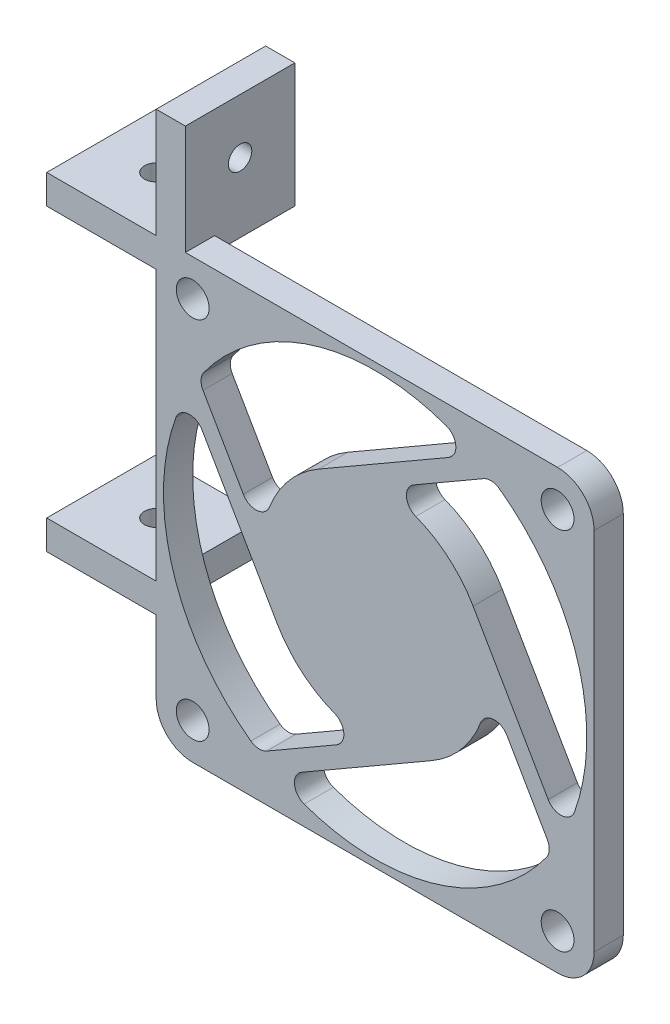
ISO-10303-21;
HEADER;
FILE_DESCRIPTION(('STEP AP214'),'2;1');
FILE_NAME('part.step','',(''),(''),'','','');
FILE_SCHEMA(('AUTOMOTIVE_DESIGN { 1 0 10303 214 1 1 1 1 }'));
ENDSEC;
DATA;
#1=APPLICATION_CONTEXT('core data for automotive mechanical design processes');
#2=APPLICATION_PROTOCOL_DEFINITION('international standard','automotive_design',2000,#1);
#3=PRODUCT_CONTEXT('',#1,'mechanical');
#4=PRODUCT('Part','Part','',(#3));
#5=PRODUCT_RELATED_PRODUCT_CATEGORY('part','',(#4));
#6=PRODUCT_DEFINITION_FORMATION('','',#4);
#7=PRODUCT_DEFINITION_CONTEXT('part definition',#1,'design');
#8=PRODUCT_DEFINITION('design','',#6,#7);
#9=PRODUCT_DEFINITION_SHAPE('','',#8);
#10=(LENGTH_UNIT() NAMED_UNIT(*) SI_UNIT(.MILLI.,.METRE.));
#11=(NAMED_UNIT(*) PLANE_ANGLE_UNIT() SI_UNIT($,.RADIAN.));
#12=(NAMED_UNIT(*) SI_UNIT($,.STERADIAN.) SOLID_ANGLE_UNIT());
#13=UNCERTAINTY_MEASURE_WITH_UNIT(LENGTH_MEASURE(1.E-05),#10,'distance_accuracy_value','');
#14=(GEOMETRIC_REPRESENTATION_CONTEXT(3) GLOBAL_UNCERTAINTY_ASSIGNED_CONTEXT((#13)) GLOBAL_UNIT_ASSIGNED_CONTEXT((#10,
#11,#12)) REPRESENTATION_CONTEXT('',''));
#15=CARTESIAN_POINT('',(0.,0.,0.));
#16=DIRECTION('',(0.,0.,1.));
#17=DIRECTION('',(1.,0.,0.));
#18=AXIS2_PLACEMENT_3D('',#15,#16,#17);
#19=CARTESIAN_POINT('',(0.,0.,-4.));
#20=DIRECTION('',(-1.,0.,0.));
#21=DIRECTION('',(0.,0.,1.));
#22=AXIS2_PLACEMENT_3D('',#19,#20,#21);
#23=PLANE('',#22);
#24=DIRECTION('',(0.,0.,1.));
#25=VECTOR('',#24,1.);
#26=CARTESIAN_POINT('',(0.,15.,-15.));
#27=LINE('',#26,#25);
#28=CARTESIAN_POINT('',(0.,15.,-4.));
#29=VERTEX_POINT('',#28);
#30=CARTESIAN_POINT('',(0.,15.,0.));
#31=VERTEX_POINT('',#30);
#32=EDGE_CURVE('E441',#29,#31,#27,.T.);
#33=ORIENTED_EDGE('',*,*,#32,.F.);
#34=DIRECTION('',(0.,-1.,0.));
#35=VECTOR('',#34,1.);
#36=CARTESIAN_POINT('',(0.,0.,-4.));
#37=LINE('',#36,#35);
#38=CARTESIAN_POINT('',(0.,5.,-4.));
#39=VERTEX_POINT('',#38);
#40=EDGE_CURVE('E702',#29,#39,#37,.T.);
#41=ORIENTED_EDGE('',*,*,#40,.T.);
#42=DIRECTION('',(0.,0.,1.));
#43=VECTOR('',#42,1.);
#44=CARTESIAN_POINT('',(0.,5.,-4.));
#45=LINE('',#44,#43);
#46=CARTESIAN_POINT('',(0.,5.,0.));
#47=VERTEX_POINT('',#46);
#48=EDGE_CURVE('E710',#39,#47,#45,.T.);
#49=ORIENTED_EDGE('',*,*,#48,.T.);
#50=DIRECTION('',(0.,-1.,0.));
#51=VECTOR('',#50,1.);
#52=CARTESIAN_POINT('',(0.,0.,0.));
#53=LINE('',#52,#51);
#54=EDGE_CURVE('E686',#31,#47,#53,.T.);
#55=ORIENTED_EDGE('',*,*,#54,.F.);
#56=EDGE_LOOP('',(#33,#41,#49,#55));
#57=FACE_BOUND('',#56,.T.);
#58=ADVANCED_FACE('F33',(#57),#23,.T.);
#59=DIRECTION('',(0.,0.,1.));
#60=VECTOR('',#59,1.);
#61=CARTESIAN_POINT('',(0.,56.,-4.));
#62=LINE('',#61,#60);
#63=CARTESIAN_POINT('',(0.,56.,-4.));
#64=VERTEX_POINT('',#63);
#65=CARTESIAN_POINT('',(0.,56.,0.));
#66=VERTEX_POINT('',#65);
#67=EDGE_CURVE('E413',#64,#66,#62,.T.);
#68=ORIENTED_EDGE('',*,*,#67,.F.);
#69=CARTESIAN_POINT('',(0.,19.,-4.));
#70=VERTEX_POINT('',#69);
#71=EDGE_CURVE('E699',#64,#70,#37,.T.);
#72=ORIENTED_EDGE('',*,*,#71,.T.);
#73=DIRECTION('',(0.,0.,1.));
#74=VECTOR('',#73,1.);
#75=CARTESIAN_POINT('',(0.,19.,-15.));
#76=LINE('',#75,#74);
#77=CARTESIAN_POINT('',(0.,19.,0.));
#78=VERTEX_POINT('',#77);
#79=EDGE_CURVE('E430',#70,#78,#76,.T.);
#80=ORIENTED_EDGE('',*,*,#79,.T.);
#81=EDGE_CURVE('E711',#66,#78,#53,.T.);
#82=ORIENTED_EDGE('',*,*,#81,.F.);
#83=EDGE_LOOP('',(#68,#72,#80,#82));
#84=FACE_BOUND('',#83,.T.);
#85=ADVANCED_FACE('F796',(#84),#23,.T.);
#86=CARTESIAN_POINT('',(0.,60.,-4.));
#87=DIRECTION('',(0.,1.,0.));
#88=DIRECTION('',(0.,0.,1.));
#89=AXIS2_PLACEMENT_3D('',#86,#87,#88);
#90=PLANE('',#89);
#91=DIRECTION('',(0.,0.,-1.));
#92=VECTOR('',#91,1.);
#93=CARTESIAN_POINT('',(4.,60.,-4.));
#94=LINE('',#93,#92);
#95=CARTESIAN_POINT('',(4.,60.,0.));
#96=VERTEX_POINT('',#95);
#97=CARTESIAN_POINT('',(4.,60.,-4.));
#98=VERTEX_POINT('',#97);
#99=EDGE_CURVE('E408',#96,#98,#94,.T.);
#100=ORIENTED_EDGE('',*,*,#99,.F.);
#101=DIRECTION('',(-1.,0.,0.));
#102=VECTOR('',#101,1.);
#103=CARTESIAN_POINT('',(0.,60.,0.));
#104=LINE('',#103,#102);
#105=CARTESIAN_POINT('',(55.,60.,0.));
#106=VERTEX_POINT('',#105);
#107=EDGE_CURVE('E719',#106,#96,#104,.T.);
#108=ORIENTED_EDGE('',*,*,#107,.F.);
#109=DIRECTION('',(0.,0.,1.));
#110=VECTOR('',#109,1.);
#111=CARTESIAN_POINT('',(55.,60.,-4.));
#112=LINE('',#111,#110);
#113=CARTESIAN_POINT('',(55.,60.,-4.));
#114=VERTEX_POINT('',#113);
#115=EDGE_CURVE('E11',#106,#114,#112,.F.);
#116=ORIENTED_EDGE('',*,*,#115,.T.);
#117=DIRECTION('',(-1.,0.,0.));
#118=VECTOR('',#117,1.);
#119=CARTESIAN_POINT('',(0.,60.,-4.));
#120=LINE('',#119,#118);
#121=EDGE_CURVE('E708',#114,#98,#120,.T.);
#122=ORIENTED_EDGE('',*,*,#121,.T.);
#123=EDGE_LOOP('',(#100,#108,#116,#122));
#124=FACE_BOUND('',#123,.T.);
#125=ADVANCED_FACE('F815',(#124),#90,.T.);
#126=CARTESIAN_POINT('',(60.,0.,-4.));
#127=DIRECTION('',(1.,0.,0.));
#128=DIRECTION('',(0.,0.,-1.));
#129=AXIS2_PLACEMENT_3D('',#126,#127,#128);
#130=PLANE('',#129);
#131=DIRECTION('',(0.,1.,0.));
#132=VECTOR('',#131,1.);
#133=CARTESIAN_POINT('',(60.,0.,0.));
#134=LINE('',#133,#132);
#135=CARTESIAN_POINT('',(60.,5.,0.));
#136=VERTEX_POINT('',#135);
#137=CARTESIAN_POINT('',(60.,55.,0.));
#138=VERTEX_POINT('',#137);
#139=EDGE_CURVE('E716',#136,#138,#134,.T.);
#140=ORIENTED_EDGE('',*,*,#139,.F.);
#141=DIRECTION('',(0.,0.,1.));
#142=VECTOR('',#141,1.);
#143=CARTESIAN_POINT('',(60.,5.,-4.));
#144=LINE('',#143,#142);
#145=CARTESIAN_POINT('',(60.,5.,-4.));
#146=VERTEX_POINT('',#145);
#147=EDGE_CURVE('E42',#136,#146,#144,.F.);
#148=ORIENTED_EDGE('',*,*,#147,.T.);
#149=DIRECTION('',(0.,1.,0.));
#150=VECTOR('',#149,1.);
#151=CARTESIAN_POINT('',(60.,0.,-4.));
#152=LINE('',#151,#150);
#153=CARTESIAN_POINT('',(60.,55.,-4.));
#154=VERTEX_POINT('',#153);
#155=EDGE_CURVE('E705',#146,#154,#152,.T.);
#156=ORIENTED_EDGE('',*,*,#155,.T.);
#157=DIRECTION('',(0.,0.,1.));
#158=VECTOR('',#157,1.);
#159=CARTESIAN_POINT('',(60.,55.,-4.));
#160=LINE('',#159,#158);
#161=EDGE_CURVE('E742',#154,#138,#160,.T.);
#162=ORIENTED_EDGE('',*,*,#161,.T.);
#163=EDGE_LOOP('',(#140,#148,#156,#162));
#164=FACE_BOUND('',#163,.T.);
#165=ADVANCED_FACE('F749',(#164),#130,.T.);
#166=CARTESIAN_POINT('',(0.,0.,-4.));
#167=DIRECTION('',(0.,-1.,0.));
#168=DIRECTION('',(0.,0.,-1.));
#169=AXIS2_PLACEMENT_3D('',#166,#167,#168);
#170=PLANE('',#169);
#171=DIRECTION('',(1.,0.,0.));
#172=VECTOR('',#171,1.);
#173=CARTESIAN_POINT('',(0.,0.,0.));
#174=LINE('',#173,#172);
#175=CARTESIAN_POINT('',(5.,0.,0.));
#176=VERTEX_POINT('',#175);
#177=CARTESIAN_POINT('',(55.,0.,0.));
#178=VERTEX_POINT('',#177);
#179=EDGE_CURVE('E713',#176,#178,#174,.T.);
#180=ORIENTED_EDGE('',*,*,#179,.F.);
#181=DIRECTION('',(0.,0.,1.));
#182=VECTOR('',#181,1.);
#183=CARTESIAN_POINT('',(5.,0.,-4.));
#184=LINE('',#183,#182);
#185=CARTESIAN_POINT('',(5.,0.,-4.));
#186=VERTEX_POINT('',#185);
#187=EDGE_CURVE('E733',#176,#186,#184,.F.);
#188=ORIENTED_EDGE('',*,*,#187,.T.);
#189=DIRECTION('',(1.,0.,0.));
#190=VECTOR('',#189,1.);
#191=CARTESIAN_POINT('',(0.,0.,-4.));
#192=LINE('',#191,#190);
#193=CARTESIAN_POINT('',(55.,0.,-4.));
#194=VERTEX_POINT('',#193);
#195=EDGE_CURVE('E701',#186,#194,#192,.T.);
#196=ORIENTED_EDGE('',*,*,#195,.T.);
#197=DIRECTION('',(0.,0.,1.));
#198=VECTOR('',#197,1.);
#199=CARTESIAN_POINT('',(55.,0.,-4.));
#200=LINE('',#199,#198);
#201=EDGE_CURVE('E730',#194,#178,#200,.T.);
#202=ORIENTED_EDGE('',*,*,#201,.T.);
#203=EDGE_LOOP('',(#180,#188,#196,#202));
#204=FACE_BOUND('',#203,.T.);
#205=ADVANCED_FACE('F761',(#204),#170,.T.);
#206=CARTESIAN_POINT('',(0.,0.,-4.));
#207=DIRECTION('',(0.,0.,-1.));
#208=DIRECTION('',(-1.,0.,0.));
#209=AXIS2_PLACEMENT_3D('',#206,#207,#208);
#210=PLANE('',#209);
#211=DIRECTION('',(-1.,0.,0.));
#212=VECTOR('',#211,1.);
#213=CARTESIAN_POINT('',(0.,56.,-4.));
#214=LINE('',#213,#212);
#215=CARTESIAN_POINT('',(2.,56.,-4.));
#216=VERTEX_POINT('',#215);
#217=EDGE_CURVE('E411',#216,#64,#214,.T.);
#218=ORIENTED_EDGE('',*,*,#217,.F.);
#219=DIRECTION('',(-0.707106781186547,-0.707106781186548,0.));
#220=VECTOR('',#219,1.);
#221=CARTESIAN_POINT('',(-27.,27.,-4.));
#222=LINE('',#221,#220);
#223=CARTESIAN_POINT('',(4.,58.,-4.));
#224=VERTEX_POINT('',#223);
#225=EDGE_CURVE('E49',#224,#216,#222,.T.);
#226=ORIENTED_EDGE('',*,*,#225,.F.);
#227=DIRECTION('',(0.,-1.,0.));
#228=VECTOR('',#227,1.);
#229=CARTESIAN_POINT('',(4.00000000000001,0.,-4.));
#230=LINE('',#229,#228);
#231=EDGE_CURVE('E53',#98,#224,#230,.T.);
#232=ORIENTED_EDGE('',*,*,#231,.F.);
#233=ORIENTED_EDGE('',*,*,#121,.F.);
#234=CARTESIAN_POINT('',(55.,55.,-4.));
#235=DIRECTION('',(0.,0.,-1.));
#236=DIRECTION('',(-1.,0.,0.));
#237=AXIS2_PLACEMENT_3D('',#234,#235,#236);
#238=CIRCLE('',#237,5.);
#239=EDGE_CURVE('E735',#114,#154,#238,.T.);
#240=ORIENTED_EDGE('',*,*,#239,.T.);
#241=ORIENTED_EDGE('',*,*,#155,.F.);
#242=CARTESIAN_POINT('',(55.,5.,-4.));
#243=DIRECTION('',(0.,0.,-1.));
#244=DIRECTION('',(-1.,0.,0.));
#245=AXIS2_PLACEMENT_3D('',#242,#243,#244);
#246=CIRCLE('',#245,5.);
#247=EDGE_CURVE('E737',#146,#194,#246,.T.);
#248=ORIENTED_EDGE('',*,*,#247,.T.);
#249=ORIENTED_EDGE('',*,*,#195,.F.);
#250=CARTESIAN_POINT('',(5.,5.,-4.));
#251=DIRECTION('',(0.,0.,-1.));
#252=DIRECTION('',(-1.,0.,0.));
#253=AXIS2_PLACEMENT_3D('',#250,#251,#252);
#254=CIRCLE('',#253,5.);
#255=EDGE_CURVE('E739',#186,#39,#254,.T.);
#256=ORIENTED_EDGE('',*,*,#255,.T.);
#257=ORIENTED_EDGE('',*,*,#40,.F.);
#258=DIRECTION('',(0.,-1.,0.));
#259=VECTOR('',#258,1.);
#260=CARTESIAN_POINT('',(0.,0.,-4.));
#261=LINE('',#260,#259);
#262=EDGE_CURVE('E440',#70,#29,#261,.T.);
#263=ORIENTED_EDGE('',*,*,#262,.F.);
#264=ORIENTED_EDGE('',*,*,#71,.F.);
#265=EDGE_LOOP('',(#218,#226,#232,#233,#240,#241,#248,#249,#256,#257,#263,#264));
#266=FACE_BOUND('',#265,.T.);
#267=CARTESIAN_POINT('',(14.1458434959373,8.14489255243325,-4.));
#268=DIRECTION('',(0.,0.,1.));
#269=DIRECTION('',(-1.,0.,0.));
#270=AXIS2_PLACEMENT_3D('',#267,#268,#269);
#271=CIRCLE('',#270,2.);
#272=CARTESIAN_POINT('',(12.9714615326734,6.52599570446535,-4.));
#273=VERTEX_POINT('',#272);
#274=CARTESIAN_POINT('',(15.1458434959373,6.41284174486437,-4.));
#275=VERTEX_POINT('',#274);
#276=EDGE_CURVE('E451',#273,#275,#271,.T.);
#277=ORIENTED_EDGE('',*,*,#276,.T.);
#278=DIRECTION('',(0.86602540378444,0.499999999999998,0.));
#279=VECTOR('',#278,1.);
#280=CARTESIAN_POINT('',(15.1458434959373,6.41284174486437,-4.));
#281=LINE('',#280,#279);
#282=CARTESIAN_POINT('',(24.7128247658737,11.9363409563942,-4.));
#283=VERTEX_POINT('',#282);
#284=EDGE_CURVE('E454',#275,#283,#281,.T.);
#285=ORIENTED_EDGE('',*,*,#284,.T.);
#286=CARTESIAN_POINT('',(23.7128247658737,13.6683917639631,-4.));
#287=DIRECTION('',(0.,0.,1.));
#288=DIRECTION('',(1.,0.,0.));
#289=AXIS2_PLACEMENT_3D('',#286,#287,#288);
#290=CIRCLE('',#289,2.);
#291=CARTESIAN_POINT('',(24.4313590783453,15.534861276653,-4.));
#292=VERTEX_POINT('',#291);
#293=EDGE_CURVE('E458',#283,#292,#290,.T.);
#294=ORIENTED_EDGE('',*,*,#293,.T.);
#295=CARTESIAN_POINT('',(30.,30.,-4.));
#296=DIRECTION('',(0.,0.,-1.));
#297=DIRECTION('',(1.,0.,0.));
#298=AXIS2_PLACEMENT_3D('',#295,#296,#297);
#299=CIRCLE('',#298,15.5);
#300=CARTESIAN_POINT('',(16.5766062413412,22.25,-4.));
#301=VERTEX_POINT('',#300);
#302=EDGE_CURVE('E461',#292,#301,#299,.T.);
#303=ORIENTED_EDGE('',*,*,#302,.T.);
#304=DIRECTION('',(-0.499999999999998,0.86602540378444,0.));
#305=VECTOR('',#304,1.);
#306=CARTESIAN_POINT('',(16.5766062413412,22.25,-4.));
#307=LINE('',#306,#305);
#308=CARTESIAN_POINT('',(6.29616364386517,40.0562489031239,-4.));
#309=VERTEX_POINT('',#308);
#310=EDGE_CURVE('E464',#301,#309,#307,.T.);
#311=ORIENTED_EDGE('',*,*,#310,.T.);
#312=CARTESIAN_POINT('',(4.5641128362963,39.0562489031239,-4.));
#313=DIRECTION('',(0.,0.,1.));
#314=DIRECTION('',(1.,0.,0.));
#315=AXIS2_PLACEMENT_3D('',#312,#313,#314);
#316=CIRCLE('',#315,2.);
#317=CARTESIAN_POINT('',(2.67997304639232,39.7270821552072,-4.));
#318=VERTEX_POINT('',#317);
#319=EDGE_CURVE('E467',#309,#318,#316,.T.);
#320=ORIENTED_EDGE('',*,*,#319,.T.);
#321=CARTESIAN_POINT('',(30.,30.,-4.));
#322=DIRECTION('',(0.,0.,1.));
#323=DIRECTION('',(1.,0.,0.));
#324=AXIS2_PLACEMENT_3D('',#321,#322,#323);
#325=CIRCLE('',#324,29.);
#326=EDGE_CURVE('E470',#318,#273,#325,.T.);
#327=ORIENTED_EDGE('',*,*,#326,.T.);
#328=EDGE_LOOP('',(#277,#285,#294,#303,#311,#320,#327));
#329=FACE_BOUND('',#328,.T.);
#330=CARTESIAN_POINT('',(51.8551074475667,14.1458434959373,-4.));
#331=DIRECTION('',(0.,0.,1.));
#332=DIRECTION('',(-1.,0.,0.));
#333=AXIS2_PLACEMENT_3D('',#330,#331,#332);
#334=CIRCLE('',#333,2.);
#335=CARTESIAN_POINT('',(53.4740042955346,12.9714615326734,-4.));
#336=VERTEX_POINT('',#335);
#337=CARTESIAN_POINT('',(53.5871582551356,15.1458434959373,-4.));
#338=VERTEX_POINT('',#337);
#339=EDGE_CURVE('E507',#336,#338,#334,.T.);
#340=ORIENTED_EDGE('',*,*,#339,.T.);
#341=DIRECTION('',(-0.499999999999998,0.86602540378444,0.));
#342=VECTOR('',#341,1.);
#343=CARTESIAN_POINT('',(53.5871582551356,15.1458434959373,-4.));
#344=LINE('',#343,#342);
#345=CARTESIAN_POINT('',(48.0636590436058,24.7128247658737,-4.));
#346=VERTEX_POINT('',#345);
#347=EDGE_CURVE('E510',#338,#346,#344,.T.);
#348=ORIENTED_EDGE('',*,*,#347,.T.);
#349=CARTESIAN_POINT('',(46.3316082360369,23.7128247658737,-4.));
#350=DIRECTION('',(0.,0.,1.));
#351=DIRECTION('',(1.,0.,0.));
#352=AXIS2_PLACEMENT_3D('',#349,#350,#351);
#353=CIRCLE('',#352,2.00000000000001);
#354=CARTESIAN_POINT('',(44.465138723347,24.4313590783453,-4.));
#355=VERTEX_POINT('',#354);
#356=EDGE_CURVE('E514',#346,#355,#353,.T.);
#357=ORIENTED_EDGE('',*,*,#356,.T.);
#358=CARTESIAN_POINT('',(30.,30.,-4.));
#359=DIRECTION('',(0.,0.,-1.));
#360=DIRECTION('',(1.,0.,0.));
#361=AXIS2_PLACEMENT_3D('',#358,#359,#360);
#362=CIRCLE('',#361,15.5);
#363=CARTESIAN_POINT('',(37.75,16.5766062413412,-4.));
#364=VERTEX_POINT('',#363);
#365=EDGE_CURVE('E517',#355,#364,#362,.T.);
#366=ORIENTED_EDGE('',*,*,#365,.T.);
#367=DIRECTION('',(-0.866025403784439,-0.499999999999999,0.));
#368=VECTOR('',#367,1.);
#369=CARTESIAN_POINT('',(37.75,16.5766062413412,-4.));
#370=LINE('',#369,#368);
#371=CARTESIAN_POINT('',(19.9437510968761,6.29616364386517,-4.));
#372=VERTEX_POINT('',#371);
#373=EDGE_CURVE('E520',#364,#372,#370,.T.);
#374=ORIENTED_EDGE('',*,*,#373,.T.);
#375=CARTESIAN_POINT('',(20.9437510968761,4.5641128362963,-4.));
#376=DIRECTION('',(0.,0.,1.));
#377=DIRECTION('',(1.,0.,0.));
#378=AXIS2_PLACEMENT_3D('',#375,#376,#377);
#379=CIRCLE('',#378,2.);
#380=CARTESIAN_POINT('',(20.2729178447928,2.67997304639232,-4.));
#381=VERTEX_POINT('',#380);
#382=EDGE_CURVE('E523',#372,#381,#379,.T.);
#383=ORIENTED_EDGE('',*,*,#382,.T.);
#384=CARTESIAN_POINT('',(30.,30.,-4.));
#385=DIRECTION('',(0.,0.,1.));
#386=DIRECTION('',(1.,0.,0.));
#387=AXIS2_PLACEMENT_3D('',#384,#385,#386);
#388=CIRCLE('',#387,29.);
#389=EDGE_CURVE('E526',#381,#336,#388,.T.);
#390=ORIENTED_EDGE('',*,*,#389,.T.);
#391=EDGE_LOOP('',(#340,#348,#357,#366,#374,#383,#390));
#392=FACE_BOUND('',#391,.T.);
#393=CARTESIAN_POINT('',(30.,30.,-4.));
#394=DIRECTION('',(0.,0.,-1.));
#395=DIRECTION('',(1.,0.,0.));
#396=AXIS2_PLACEMENT_3D('',#393,#394,#395);
#397=CIRCLE('',#396,15.5);
#398=CARTESIAN_POINT('',(15.534861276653,35.5686409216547,-4.));
#399=VERTEX_POINT('',#398);
#400=CARTESIAN_POINT('',(22.25,43.4233937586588,-4.));
#401=VERTEX_POINT('',#400);
#402=EDGE_CURVE('E563',#399,#401,#397,.T.);
#403=ORIENTED_EDGE('',*,*,#402,.T.);
#404=DIRECTION('',(0.86602540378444,0.499999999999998,0.));
#405=VECTOR('',#404,1.);
#406=CARTESIAN_POINT('',(22.25,43.4233937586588,-4.));
#407=LINE('',#406,#405);
#408=CARTESIAN_POINT('',(40.0562489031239,53.7038363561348,-4.));
#409=VERTEX_POINT('',#408);
#410=EDGE_CURVE('E566',#401,#409,#407,.T.);
#411=ORIENTED_EDGE('',*,*,#410,.T.);
#412=CARTESIAN_POINT('',(39.0562489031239,55.4358871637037,-4.));
#413=DIRECTION('',(0.,0.,1.));
#414=DIRECTION('',(1.,0.,0.));
#415=AXIS2_PLACEMENT_3D('',#412,#413,#414);
#416=CIRCLE('',#415,2.);
#417=CARTESIAN_POINT('',(39.7270821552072,57.3200269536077,-4.));
#418=VERTEX_POINT('',#417);
#419=EDGE_CURVE('E570',#409,#418,#416,.T.);
#420=ORIENTED_EDGE('',*,*,#419,.T.);
#421=CARTESIAN_POINT('',(30.,30.,-4.));
#422=DIRECTION('',(0.,0.,1.));
#423=DIRECTION('',(1.,0.,0.));
#424=AXIS2_PLACEMENT_3D('',#421,#422,#423);
#425=CIRCLE('',#424,29.);
#426=CARTESIAN_POINT('',(6.52599570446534,47.0285384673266,-4.));
#427=VERTEX_POINT('',#426);
#428=EDGE_CURVE('E573',#418,#427,#425,.T.);
#429=ORIENTED_EDGE('',*,*,#428,.T.);
#430=CARTESIAN_POINT('',(8.14489255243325,45.8541565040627,-4.));
#431=DIRECTION('',(0.,0.,1.));
#432=DIRECTION('',(-1.,0.,0.));
#433=AXIS2_PLACEMENT_3D('',#430,#431,#432);
#434=CIRCLE('',#433,2.);
#435=CARTESIAN_POINT('',(6.41284174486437,44.8541565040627,-4.));
#436=VERTEX_POINT('',#435);
#437=EDGE_CURVE('E576',#427,#436,#434,.T.);
#438=ORIENTED_EDGE('',*,*,#437,.T.);
#439=DIRECTION('',(0.499999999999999,-0.866025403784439,0.));
#440=VECTOR('',#439,1.);
#441=CARTESIAN_POINT('',(6.41284174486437,44.8541565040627,-4.));
#442=LINE('',#441,#440);
#443=CARTESIAN_POINT('',(11.9363409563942,35.2871752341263,-4.));
#444=VERTEX_POINT('',#443);
#445=EDGE_CURVE('E579',#436,#444,#442,.T.);
#446=ORIENTED_EDGE('',*,*,#445,.T.);
#447=CARTESIAN_POINT('',(13.6683917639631,36.2871752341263,-4.));
#448=DIRECTION('',(0.,0.,1.));
#449=DIRECTION('',(1.,0.,0.));
#450=AXIS2_PLACEMENT_3D('',#447,#448,#449);
#451=CIRCLE('',#450,2.);
#452=EDGE_CURVE('E582',#444,#399,#451,.T.);
#453=ORIENTED_EDGE('',*,*,#452,.T.);
#454=EDGE_LOOP('',(#403,#411,#420,#429,#438,#446,#453));
#455=FACE_BOUND('',#454,.T.);
#456=CARTESIAN_POINT('',(5.,55.,-4.));
#457=DIRECTION('',(0.,0.,1.));
#458=DIRECTION('',(-1.,0.,0.));
#459=AXIS2_PLACEMENT_3D('',#456,#457,#458);
#460=CIRCLE('',#459,2.25);
#461=CARTESIAN_POINT('',(2.75,55.,-4.));
#462=VERTEX_POINT('',#461);
#463=EDGE_CURVE('E619',#462,#462,#460,.T.);
#464=ORIENTED_EDGE('',*,*,#463,.T.);
#465=EDGE_LOOP('',(#464));
#466=FACE_BOUND('',#465,.T.);
#467=CARTESIAN_POINT('',(55.,55.,-4.));
#468=DIRECTION('',(0.,0.,1.));
#469=DIRECTION('',(1.,0.,0.));
#470=AXIS2_PLACEMENT_3D('',#467,#468,#469);
#471=CIRCLE('',#470,2.25);
#472=CARTESIAN_POINT('',(57.25,55.,-4.));
#473=VERTEX_POINT('',#472);
#474=EDGE_CURVE('E625',#473,#473,#471,.T.);
#475=ORIENTED_EDGE('',*,*,#474,.T.);
#476=EDGE_LOOP('',(#475));
#477=FACE_BOUND('',#476,.T.);
#478=CARTESIAN_POINT('',(55.,5.,-4.));
#479=DIRECTION('',(0.,0.,1.));
#480=DIRECTION('',(-1.,0.,0.));
#481=AXIS2_PLACEMENT_3D('',#478,#479,#480);
#482=CIRCLE('',#481,2.25);
#483=CARTESIAN_POINT('',(52.75,5.,-4.));
#484=VERTEX_POINT('',#483);
#485=EDGE_CURVE('E631',#484,#484,#482,.T.);
#486=ORIENTED_EDGE('',*,*,#485,.T.);
#487=EDGE_LOOP('',(#486));
#488=FACE_BOUND('',#487,.T.);
#489=CARTESIAN_POINT('',(5.,5.,-4.));
#490=DIRECTION('',(0.,0.,1.));
#491=DIRECTION('',(1.,0.,0.));
#492=AXIS2_PLACEMENT_3D('',#489,#490,#491);
#493=CIRCLE('',#492,2.25);
#494=CARTESIAN_POINT('',(7.25,5.,-4.));
#495=VERTEX_POINT('',#494);
#496=EDGE_CURVE('E637',#495,#495,#493,.T.);
#497=ORIENTED_EDGE('',*,*,#496,.T.);
#498=EDGE_LOOP('',(#497));
#499=FACE_BOUND('',#498,.T.);
#500=CARTESIAN_POINT('',(45.8541565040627,51.8551074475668,-4.));
#501=DIRECTION('',(0.,0.,1.));
#502=DIRECTION('',(-1.,0.,0.));
#503=AXIS2_PLACEMENT_3D('',#500,#501,#502);
#504=CIRCLE('',#503,2.);
#505=CARTESIAN_POINT('',(47.0285384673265,53.4740042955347,-4.));
#506=VERTEX_POINT('',#505);
#507=CARTESIAN_POINT('',(44.8541565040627,53.5871582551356,-4.));
#508=VERTEX_POINT('',#507);
#509=EDGE_CURVE('E643',#506,#508,#504,.T.);
#510=ORIENTED_EDGE('',*,*,#509,.T.);
#511=DIRECTION('',(-0.866025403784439,-0.499999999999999,0.));
#512=VECTOR('',#511,1.);
#513=CARTESIAN_POINT('',(44.8541565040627,53.5871582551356,-4.));
#514=LINE('',#513,#512);
#515=CARTESIAN_POINT('',(35.2871752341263,48.0636590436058,-4.));
#516=VERTEX_POINT('',#515);
#517=EDGE_CURVE('E646',#508,#516,#514,.T.);
#518=ORIENTED_EDGE('',*,*,#517,.T.);
#519=CARTESIAN_POINT('',(36.2871752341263,46.3316082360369,-4.));
#520=DIRECTION('',(0.,0.,1.));
#521=DIRECTION('',(1.,0.,0.));
#522=AXIS2_PLACEMENT_3D('',#519,#520,#521);
#523=CIRCLE('',#522,2.);
#524=CARTESIAN_POINT('',(35.5686409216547,44.465138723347,-4.));
#525=VERTEX_POINT('',#524);
#526=EDGE_CURVE('E650',#516,#525,#523,.T.);
#527=ORIENTED_EDGE('',*,*,#526,.T.);
#528=CARTESIAN_POINT('',(30.,30.,-4.));
#529=DIRECTION('',(0.,0.,-1.));
#530=DIRECTION('',(1.,0.,0.));
#531=AXIS2_PLACEMENT_3D('',#528,#529,#530);
#532=CIRCLE('',#531,15.5);
#533=CARTESIAN_POINT('',(43.4233937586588,37.75,-4.));
#534=VERTEX_POINT('',#533);
#535=EDGE_CURVE('E653',#525,#534,#532,.T.);
#536=ORIENTED_EDGE('',*,*,#535,.T.);
#537=DIRECTION('',(0.499999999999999,-0.866025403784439,0.));
#538=VECTOR('',#537,1.);
#539=CARTESIAN_POINT('',(43.4233937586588,37.75,-4.));
#540=LINE('',#539,#538);
#541=CARTESIAN_POINT('',(53.7038363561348,19.9437510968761,-4.));
#542=VERTEX_POINT('',#541);
#543=EDGE_CURVE('E656',#534,#542,#540,.T.);
#544=ORIENTED_EDGE('',*,*,#543,.T.);
#545=CARTESIAN_POINT('',(55.4358871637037,20.9437510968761,-4.));
#546=DIRECTION('',(0.,0.,1.));
#547=DIRECTION('',(1.,0.,0.));
#548=AXIS2_PLACEMENT_3D('',#545,#546,#547);
#549=CIRCLE('',#548,2.);
#550=CARTESIAN_POINT('',(57.3200269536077,20.2729178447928,-4.));
#551=VERTEX_POINT('',#550);
#552=EDGE_CURVE('E659',#542,#551,#549,.T.);
#553=ORIENTED_EDGE('',*,*,#552,.T.);
#554=CARTESIAN_POINT('',(30.,30.,-4.));
#555=DIRECTION('',(0.,0.,1.));
#556=DIRECTION('',(1.,0.,0.));
#557=AXIS2_PLACEMENT_3D('',#554,#555,#556);
#558=CIRCLE('',#557,29.);
#559=EDGE_CURVE('E662',#551,#506,#558,.T.);
#560=ORIENTED_EDGE('',*,*,#559,.T.);
#561=EDGE_LOOP('',(#510,#518,#527,#536,#544,#553,#560));
#562=FACE_BOUND('',#561,.T.);
#563=ADVANCED_FACE('F753',(#266,#329,#392,#455,#466,#477,#488,#499,#562),#210,.T.);
#564=CARTESIAN_POINT('',(0.,0.,0.));
#565=DIRECTION('',(0.,0.,-1.));
#566=DIRECTION('',(-1.,0.,0.));
#567=AXIS2_PLACEMENT_3D('',#564,#565,#566);
#568=PLANE('',#567);
#569=DIRECTION('',(0.,-1.,0.));
#570=VECTOR('',#569,1.);
#571=CARTESIAN_POINT('',(0.,60.,0.));
#572=LINE('',#571,#570);
#573=CARTESIAN_POINT('',(0.,75.,0.));
#574=VERTEX_POINT('',#573);
#575=CARTESIAN_POINT('',(0.,60.,0.));
#576=VERTEX_POINT('',#575);
#577=EDGE_CURVE('E390',#574,#576,#572,.T.);
#578=ORIENTED_EDGE('',*,*,#577,.T.);
#579=DIRECTION('',(-1.,0.,0.));
#580=VECTOR('',#579,1.);
#581=CARTESIAN_POINT('',(0.,60.,0.));
#582=LINE('',#581,#580);
#583=CARTESIAN_POINT('',(-15.,60.,0.));
#584=VERTEX_POINT('',#583);
#585=EDGE_CURVE('E365',#576,#584,#582,.T.);
#586=ORIENTED_EDGE('',*,*,#585,.T.);
#587=DIRECTION('',(0.,-1.,0.));
#588=VECTOR('',#587,1.);
#589=CARTESIAN_POINT('',(-15.,56.,0.));
#590=LINE('',#589,#588);
#591=CARTESIAN_POINT('',(-15.,56.,0.));
#592=VERTEX_POINT('',#591);
#593=EDGE_CURVE('E362',#584,#592,#590,.T.);
#594=ORIENTED_EDGE('',*,*,#593,.T.);
#595=DIRECTION('',(1.,0.,0.));
#596=VECTOR('',#595,1.);
#597=CARTESIAN_POINT('',(2.,56.,0.));
#598=LINE('',#597,#596);
#599=EDGE_CURVE('E382',#592,#66,#598,.T.);
#600=ORIENTED_EDGE('',*,*,#599,.T.);
#601=ORIENTED_EDGE('',*,*,#81,.T.);
#602=DIRECTION('',(-1.,0.,0.));
#603=VECTOR('',#602,1.);
#604=CARTESIAN_POINT('',(0.,19.,0.));
#605=LINE('',#604,#603);
#606=CARTESIAN_POINT('',(-15.,19.,0.));
#607=VERTEX_POINT('',#606);
#608=EDGE_CURVE('E416',#78,#607,#605,.T.);
#609=ORIENTED_EDGE('',*,*,#608,.T.);
#610=DIRECTION('',(0.,-1.,0.));
#611=VECTOR('',#610,1.);
#612=CARTESIAN_POINT('',(-15.,19.,0.));
#613=LINE('',#612,#611);
#614=CARTESIAN_POINT('',(-15.,15.,0.));
#615=VERTEX_POINT('',#614);
#616=EDGE_CURVE('E433',#607,#615,#613,.T.);
#617=ORIENTED_EDGE('',*,*,#616,.T.);
#618=DIRECTION('',(1.,0.,0.));
#619=VECTOR('',#618,1.);
#620=CARTESIAN_POINT('',(0.,15.,0.));
#621=LINE('',#620,#619);
#622=EDGE_CURVE('E421',#615,#31,#621,.T.);
#623=ORIENTED_EDGE('',*,*,#622,.T.);
#624=ORIENTED_EDGE('',*,*,#54,.T.);
#625=CARTESIAN_POINT('',(5.,5.,0.));
#626=DIRECTION('',(0.,0.,-1.));
#627=DIRECTION('',(-1.,0.,0.));
#628=AXIS2_PLACEMENT_3D('',#625,#626,#627);
#629=CIRCLE('',#628,5.);
#630=EDGE_CURVE('E728',#47,#176,#629,.F.);
#631=ORIENTED_EDGE('',*,*,#630,.T.);
#632=ORIENTED_EDGE('',*,*,#179,.T.);
#633=CARTESIAN_POINT('',(55.,5.,0.));
#634=DIRECTION('',(0.,0.,-1.));
#635=DIRECTION('',(-1.,0.,0.));
#636=AXIS2_PLACEMENT_3D('',#633,#634,#635);
#637=CIRCLE('',#636,5.);
#638=EDGE_CURVE('E726',#178,#136,#637,.F.);
#639=ORIENTED_EDGE('',*,*,#638,.T.);
#640=ORIENTED_EDGE('',*,*,#139,.T.);
#641=CARTESIAN_POINT('',(55.,55.,0.));
#642=DIRECTION('',(0.,0.,-1.));
#643=DIRECTION('',(-1.,0.,0.));
#644=AXIS2_PLACEMENT_3D('',#641,#642,#643);
#645=CIRCLE('',#644,5.);
#646=EDGE_CURVE('E724',#138,#106,#645,.F.);
#647=ORIENTED_EDGE('',*,*,#646,.T.);
#648=ORIENTED_EDGE('',*,*,#107,.T.);
#649=DIRECTION('',(0.,1.,0.));
#650=VECTOR('',#649,1.);
#651=CARTESIAN_POINT('',(4.,58.,0.));
#652=LINE('',#651,#650);
#653=CARTESIAN_POINT('',(4.,75.,0.));
#654=VERTEX_POINT('',#653);
#655=EDGE_CURVE('E385',#96,#654,#652,.T.);
#656=ORIENTED_EDGE('',*,*,#655,.T.);
#657=DIRECTION('',(-1.,0.,0.));
#658=VECTOR('',#657,1.);
#659=CARTESIAN_POINT('',(0.,75.,0.));
#660=LINE('',#659,#658);
#661=EDGE_CURVE('E387',#654,#574,#660,.T.);
#662=ORIENTED_EDGE('',*,*,#661,.T.);
#663=EDGE_LOOP('',(#578,#586,#594,#600,#601,#609,#617,#623,#624,#631,#632,#639,#640,#647,#648,
#656,#662));
#664=FACE_BOUND('',#663,.T.);
#665=DIRECTION('',(0.86602540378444,0.499999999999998,0.));
#666=VECTOR('',#665,1.);
#667=CARTESIAN_POINT('',(15.1458434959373,6.41284174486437,0.));
#668=LINE('',#667,#666);
#669=CARTESIAN_POINT('',(15.1458434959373,6.41284174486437,0.));
#670=VERTEX_POINT('',#669);
#671=CARTESIAN_POINT('',(24.7128247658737,11.9363409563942,0.));
#672=VERTEX_POINT('',#671);
#673=EDGE_CURVE('E475',#670,#672,#668,.T.);
#674=ORIENTED_EDGE('',*,*,#673,.F.);
#675=CARTESIAN_POINT('',(14.1458434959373,8.14489255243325,0.));
#676=DIRECTION('',(0.,0.,1.));
#677=DIRECTION('',(-1.,0.,0.));
#678=AXIS2_PLACEMENT_3D('',#675,#676,#677);
#679=CIRCLE('',#678,2.);
#680=CARTESIAN_POINT('',(12.9714615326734,6.52599570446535,0.));
#681=VERTEX_POINT('',#680);
#682=EDGE_CURVE('E450',#681,#670,#679,.T.);
#683=ORIENTED_EDGE('',*,*,#682,.F.);
#684=CARTESIAN_POINT('',(30.,30.,0.));
#685=DIRECTION('',(0.,0.,1.));
#686=DIRECTION('',(1.,0.,0.));
#687=AXIS2_PLACEMENT_3D('',#684,#685,#686);
#688=CIRCLE('',#687,29.);
#689=CARTESIAN_POINT('',(2.67997304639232,39.7270821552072,0.));
#690=VERTEX_POINT('',#689);
#691=EDGE_CURVE('E455',#690,#681,#688,.T.);
#692=ORIENTED_EDGE('',*,*,#691,.F.);
#693=CARTESIAN_POINT('',(4.5641128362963,39.0562489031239,0.));
#694=DIRECTION('',(0.,0.,1.));
#695=DIRECTION('',(1.,0.,0.));
#696=AXIS2_PLACEMENT_3D('',#693,#694,#695);
#697=CIRCLE('',#696,2.);
#698=CARTESIAN_POINT('',(6.29616364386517,40.0562489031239,0.));
#699=VERTEX_POINT('',#698);
#700=EDGE_CURVE('E487',#699,#690,#697,.T.);
#701=ORIENTED_EDGE('',*,*,#700,.F.);
#702=DIRECTION('',(-0.499999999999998,0.86602540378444,0.));
#703=VECTOR('',#702,1.);
#704=CARTESIAN_POINT('',(16.5766062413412,22.25,0.));
#705=LINE('',#704,#703);
#706=CARTESIAN_POINT('',(16.5766062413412,22.25,0.));
#707=VERTEX_POINT('',#706);
#708=EDGE_CURVE('E484',#707,#699,#705,.T.);
#709=ORIENTED_EDGE('',*,*,#708,.F.);
#710=CARTESIAN_POINT('',(30.,30.,0.));
#711=DIRECTION('',(0.,0.,-1.));
#712=DIRECTION('',(1.,0.,0.));
#713=AXIS2_PLACEMENT_3D('',#710,#711,#712);
#714=CIRCLE('',#713,15.5);
#715=CARTESIAN_POINT('',(24.4313590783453,15.534861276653,0.));
#716=VERTEX_POINT('',#715);
#717=EDGE_CURVE('E481',#716,#707,#714,.T.);
#718=ORIENTED_EDGE('',*,*,#717,.F.);
#719=CARTESIAN_POINT('',(23.7128247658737,13.6683917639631,0.));
#720=DIRECTION('',(0.,0.,1.));
#721=DIRECTION('',(1.,0.,0.));
#722=AXIS2_PLACEMENT_3D('',#719,#720,#721);
#723=CIRCLE('',#722,2.);
#724=EDGE_CURVE('E478',#672,#716,#723,.T.);
#725=ORIENTED_EDGE('',*,*,#724,.F.);
#726=EDGE_LOOP('',(#674,#683,#692,#701,#709,#718,#725));
#727=FACE_BOUND('',#726,.T.);
#728=DIRECTION('',(-0.499999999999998,0.86602540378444,0.));
#729=VECTOR('',#728,1.);
#730=CARTESIAN_POINT('',(53.5871582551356,15.1458434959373,0.));
#731=LINE('',#730,#729);
#732=CARTESIAN_POINT('',(53.5871582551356,15.1458434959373,0.));
#733=VERTEX_POINT('',#732);
#734=CARTESIAN_POINT('',(48.0636590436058,24.7128247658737,0.));
#735=VERTEX_POINT('',#734);
#736=EDGE_CURVE('E531',#733,#735,#731,.T.);
#737=ORIENTED_EDGE('',*,*,#736,.F.);
#738=CARTESIAN_POINT('',(51.8551074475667,14.1458434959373,0.));
#739=DIRECTION('',(0.,0.,1.));
#740=DIRECTION('',(-1.,0.,0.));
#741=AXIS2_PLACEMENT_3D('',#738,#739,#740);
#742=CIRCLE('',#741,2.);
#743=CARTESIAN_POINT('',(53.4740042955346,12.9714615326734,0.));
#744=VERTEX_POINT('',#743);
#745=EDGE_CURVE('E494',#744,#733,#742,.T.);
#746=ORIENTED_EDGE('',*,*,#745,.F.);
#747=CARTESIAN_POINT('',(30.,30.,0.));
#748=DIRECTION('',(0.,0.,1.));
#749=DIRECTION('',(1.,0.,0.));
#750=AXIS2_PLACEMENT_3D('',#747,#748,#749);
#751=CIRCLE('',#750,29.);
#752=CARTESIAN_POINT('',(20.2729178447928,2.67997304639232,0.));
#753=VERTEX_POINT('',#752);
#754=EDGE_CURVE('E511',#753,#744,#751,.T.);
#755=ORIENTED_EDGE('',*,*,#754,.F.);
#756=CARTESIAN_POINT('',(20.9437510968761,4.5641128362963,0.));
#757=DIRECTION('',(0.,0.,1.));
#758=DIRECTION('',(1.,0.,0.));
#759=AXIS2_PLACEMENT_3D('',#756,#757,#758);
#760=CIRCLE('',#759,2.);
#761=CARTESIAN_POINT('',(19.9437510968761,6.29616364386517,0.));
#762=VERTEX_POINT('',#761);
#763=EDGE_CURVE('E543',#762,#753,#760,.T.);
#764=ORIENTED_EDGE('',*,*,#763,.F.);
#765=DIRECTION('',(-0.866025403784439,-0.499999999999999,0.));
#766=VECTOR('',#765,1.);
#767=CARTESIAN_POINT('',(37.75,16.5766062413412,0.));
#768=LINE('',#767,#766);
#769=CARTESIAN_POINT('',(37.75,16.5766062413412,0.));
#770=VERTEX_POINT('',#769);
#771=EDGE_CURVE('E540',#770,#762,#768,.T.);
#772=ORIENTED_EDGE('',*,*,#771,.F.);
#773=CARTESIAN_POINT('',(30.,30.,0.));
#774=DIRECTION('',(0.,0.,-1.));
#775=DIRECTION('',(1.,0.,0.));
#776=AXIS2_PLACEMENT_3D('',#773,#774,#775);
#777=CIRCLE('',#776,15.5);
#778=CARTESIAN_POINT('',(44.465138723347,24.4313590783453,0.));
#779=VERTEX_POINT('',#778);
#780=EDGE_CURVE('E537',#779,#770,#777,.T.);
#781=ORIENTED_EDGE('',*,*,#780,.F.);
#782=CARTESIAN_POINT('',(46.3316082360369,23.7128247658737,0.));
#783=DIRECTION('',(0.,0.,1.));
#784=DIRECTION('',(1.,0.,0.));
#785=AXIS2_PLACEMENT_3D('',#782,#783,#784);
#786=CIRCLE('',#785,2.00000000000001);
#787=EDGE_CURVE('E534',#735,#779,#786,.T.);
#788=ORIENTED_EDGE('',*,*,#787,.F.);
#789=EDGE_LOOP('',(#737,#746,#755,#764,#772,#781,#788));
#790=FACE_BOUND('',#789,.T.);
#791=DIRECTION('',(0.86602540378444,0.499999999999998,0.));
#792=VECTOR('',#791,1.);
#793=CARTESIAN_POINT('',(22.25,43.4233937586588,0.));
#794=LINE('',#793,#792);
#795=CARTESIAN_POINT('',(22.25,43.4233937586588,0.));
#796=VERTEX_POINT('',#795);
#797=CARTESIAN_POINT('',(40.0562489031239,53.7038363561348,0.));
#798=VERTEX_POINT('',#797);
#799=EDGE_CURVE('E587',#796,#798,#794,.T.);
#800=ORIENTED_EDGE('',*,*,#799,.F.);
#801=CARTESIAN_POINT('',(30.,30.,0.));
#802=DIRECTION('',(0.,0.,-1.));
#803=DIRECTION('',(1.,0.,0.));
#804=AXIS2_PLACEMENT_3D('',#801,#802,#803);
#805=CIRCLE('',#804,15.5);
#806=CARTESIAN_POINT('',(15.534861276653,35.5686409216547,0.));
#807=VERTEX_POINT('',#806);
#808=EDGE_CURVE('E550',#807,#796,#805,.T.);
#809=ORIENTED_EDGE('',*,*,#808,.F.);
#810=CARTESIAN_POINT('',(13.6683917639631,36.2871752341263,0.));
#811=DIRECTION('',(0.,0.,1.));
#812=DIRECTION('',(1.,0.,0.));
#813=AXIS2_PLACEMENT_3D('',#810,#811,#812);
#814=CIRCLE('',#813,2.);
#815=CARTESIAN_POINT('',(11.9363409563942,35.2871752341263,0.));
#816=VERTEX_POINT('',#815);
#817=EDGE_CURVE('E567',#816,#807,#814,.T.);
#818=ORIENTED_EDGE('',*,*,#817,.F.);
#819=DIRECTION('',(0.499999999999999,-0.866025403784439,0.));
#820=VECTOR('',#819,1.);
#821=CARTESIAN_POINT('',(6.41284174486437,44.8541565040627,0.));
#822=LINE('',#821,#820);
#823=CARTESIAN_POINT('',(6.41284174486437,44.8541565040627,0.));
#824=VERTEX_POINT('',#823);
#825=EDGE_CURVE('E599',#824,#816,#822,.T.);
#826=ORIENTED_EDGE('',*,*,#825,.F.);
#827=CARTESIAN_POINT('',(8.14489255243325,45.8541565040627,0.));
#828=DIRECTION('',(0.,0.,1.));
#829=DIRECTION('',(-1.,0.,0.));
#830=AXIS2_PLACEMENT_3D('',#827,#828,#829);
#831=CIRCLE('',#830,2.);
#832=CARTESIAN_POINT('',(6.52599570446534,47.0285384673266,0.));
#833=VERTEX_POINT('',#832);
#834=EDGE_CURVE('E596',#833,#824,#831,.T.);
#835=ORIENTED_EDGE('',*,*,#834,.F.);
#836=CARTESIAN_POINT('',(30.,30.,0.));
#837=DIRECTION('',(0.,0.,1.));
#838=DIRECTION('',(1.,0.,0.));
#839=AXIS2_PLACEMENT_3D('',#836,#837,#838);
#840=CIRCLE('',#839,29.);
#841=CARTESIAN_POINT('',(39.7270821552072,57.3200269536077,0.));
#842=VERTEX_POINT('',#841);
#843=EDGE_CURVE('E593',#842,#833,#840,.T.);
#844=ORIENTED_EDGE('',*,*,#843,.F.);
#845=CARTESIAN_POINT('',(39.0562489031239,55.4358871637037,0.));
#846=DIRECTION('',(0.,0.,1.));
#847=DIRECTION('',(1.,0.,0.));
#848=AXIS2_PLACEMENT_3D('',#845,#846,#847);
#849=CIRCLE('',#848,2.);
#850=EDGE_CURVE('E590',#798,#842,#849,.T.);
#851=ORIENTED_EDGE('',*,*,#850,.F.);
#852=EDGE_LOOP('',(#800,#809,#818,#826,#835,#844,#851));
#853=FACE_BOUND('',#852,.T.);
#854=CARTESIAN_POINT('',(5.,55.,0.));
#855=DIRECTION('',(0.,0.,1.));
#856=DIRECTION('',(-1.,0.,0.));
#857=AXIS2_PLACEMENT_3D('',#854,#855,#856);
#858=CIRCLE('',#857,2.25);
#859=CARTESIAN_POINT('',(2.75,55.,0.));
#860=VERTEX_POINT('',#859);
#861=EDGE_CURVE('E606',#860,#860,#858,.T.);
#862=ORIENTED_EDGE('',*,*,#861,.F.);
#863=EDGE_LOOP('',(#862));
#864=FACE_BOUND('',#863,.T.);
#865=CARTESIAN_POINT('',(55.,55.,0.));
#866=DIRECTION('',(0.,0.,1.));
#867=DIRECTION('',(1.,0.,0.));
#868=AXIS2_PLACEMENT_3D('',#865,#866,#867);
#869=CIRCLE('',#868,2.25);
#870=CARTESIAN_POINT('',(57.25,55.,0.));
#871=VERTEX_POINT('',#870);
#872=EDGE_CURVE('E622',#871,#871,#869,.T.);
#873=ORIENTED_EDGE('',*,*,#872,.F.);
#874=EDGE_LOOP('',(#873));
#875=FACE_BOUND('',#874,.T.);
#876=CARTESIAN_POINT('',(55.,5.,0.));
#877=DIRECTION('',(0.,0.,1.));
#878=DIRECTION('',(-1.,0.,0.));
#879=AXIS2_PLACEMENT_3D('',#876,#877,#878);
#880=CIRCLE('',#879,2.25);
#881=CARTESIAN_POINT('',(52.75,5.,0.));
#882=VERTEX_POINT('',#881);
#883=EDGE_CURVE('E628',#882,#882,#880,.T.);
#884=ORIENTED_EDGE('',*,*,#883,.F.);
#885=EDGE_LOOP('',(#884));
#886=FACE_BOUND('',#885,.T.);
#887=CARTESIAN_POINT('',(5.,5.,0.));
#888=DIRECTION('',(0.,0.,1.));
#889=DIRECTION('',(1.,0.,0.));
#890=AXIS2_PLACEMENT_3D('',#887,#888,#889);
#891=CIRCLE('',#890,2.25);
#892=CARTESIAN_POINT('',(7.25,5.,0.));
#893=VERTEX_POINT('',#892);
#894=EDGE_CURVE('E634',#893,#893,#891,.T.);
#895=ORIENTED_EDGE('',*,*,#894,.F.);
#896=EDGE_LOOP('',(#895));
#897=FACE_BOUND('',#896,.T.);
#898=DIRECTION('',(-0.866025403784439,-0.499999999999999,0.));
#899=VECTOR('',#898,1.);
#900=CARTESIAN_POINT('',(44.8541565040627,53.5871582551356,0.));
#901=LINE('',#900,#899);
#902=CARTESIAN_POINT('',(44.8541565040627,53.5871582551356,0.));
#903=VERTEX_POINT('',#902);
#904=CARTESIAN_POINT('',(35.2871752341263,48.0636590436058,0.));
#905=VERTEX_POINT('',#904);
#906=EDGE_CURVE('E667',#903,#905,#901,.T.);
#907=ORIENTED_EDGE('',*,*,#906,.F.);
#908=CARTESIAN_POINT('',(45.8541565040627,51.8551074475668,0.));
#909=DIRECTION('',(0.,0.,1.));
#910=DIRECTION('',(-1.,0.,0.));
#911=AXIS2_PLACEMENT_3D('',#908,#909,#910);
#912=CIRCLE('',#911,2.);
#913=CARTESIAN_POINT('',(47.0285384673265,53.4740042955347,0.));
#914=VERTEX_POINT('',#913);
#915=EDGE_CURVE('E640',#914,#903,#912,.T.);
#916=ORIENTED_EDGE('',*,*,#915,.F.);
#917=CARTESIAN_POINT('',(30.,30.,0.));
#918=DIRECTION('',(0.,0.,1.));
#919=DIRECTION('',(1.,0.,0.));
#920=AXIS2_PLACEMENT_3D('',#917,#918,#919);
#921=CIRCLE('',#920,29.);
#922=CARTESIAN_POINT('',(57.3200269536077,20.2729178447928,0.));
#923=VERTEX_POINT('',#922);
#924=EDGE_CURVE('E647',#923,#914,#921,.T.);
#925=ORIENTED_EDGE('',*,*,#924,.F.);
#926=CARTESIAN_POINT('',(55.4358871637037,20.9437510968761,0.));
#927=DIRECTION('',(0.,0.,1.));
#928=DIRECTION('',(1.,0.,0.));
#929=AXIS2_PLACEMENT_3D('',#926,#927,#928);
#930=CIRCLE('',#929,2.);
#931=CARTESIAN_POINT('',(53.7038363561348,19.9437510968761,0.));
#932=VERTEX_POINT('',#931);
#933=EDGE_CURVE('E679',#932,#923,#930,.T.);
#934=ORIENTED_EDGE('',*,*,#933,.F.);
#935=DIRECTION('',(0.499999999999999,-0.866025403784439,0.));
#936=VECTOR('',#935,1.);
#937=CARTESIAN_POINT('',(43.4233937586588,37.75,0.));
#938=LINE('',#937,#936);
#939=CARTESIAN_POINT('',(43.4233937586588,37.75,0.));
#940=VERTEX_POINT('',#939);
#941=EDGE_CURVE('E676',#940,#932,#938,.T.);
#942=ORIENTED_EDGE('',*,*,#941,.F.);
#943=CARTESIAN_POINT('',(30.,30.,0.));
#944=DIRECTION('',(0.,0.,-1.));
#945=DIRECTION('',(1.,0.,0.));
#946=AXIS2_PLACEMENT_3D('',#943,#944,#945);
#947=CIRCLE('',#946,15.5);
#948=CARTESIAN_POINT('',(35.5686409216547,44.465138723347,0.));
#949=VERTEX_POINT('',#948);
#950=EDGE_CURVE('E673',#949,#940,#947,.T.);
#951=ORIENTED_EDGE('',*,*,#950,.F.);
#952=CARTESIAN_POINT('',(36.2871752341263,46.3316082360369,0.));
#953=DIRECTION('',(0.,0.,1.));
#954=DIRECTION('',(1.,0.,0.));
#955=AXIS2_PLACEMENT_3D('',#952,#953,#954);
#956=CIRCLE('',#955,2.);
#957=EDGE_CURVE('E670',#905,#949,#956,.T.);
#958=ORIENTED_EDGE('',*,*,#957,.F.);
#959=EDGE_LOOP('',(#907,#916,#925,#934,#942,#951,#958));
#960=FACE_BOUND('',#959,.T.);
#961=ADVANCED_FACE('F764',(#664,#727,#790,#853,#864,#875,#886,#897,#960),#568,.F.);
#962=CARTESIAN_POINT('',(45.8541565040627,51.8551074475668,-4.));
#963=DIRECTION('',(0.,0.,1.));
#964=DIRECTION('',(1.,0.,0.));
#965=AXIS2_PLACEMENT_3D('',#962,#963,#964);
#966=CYLINDRICAL_SURFACE('',#965,2.);
#967=ORIENTED_EDGE('',*,*,#915,.T.);
#968=DIRECTION('',(0.,0.,1.));
#969=VECTOR('',#968,1.);
#970=CARTESIAN_POINT('',(44.8541565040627,53.5871582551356,-4.));
#971=LINE('',#970,#969);
#972=EDGE_CURVE('E665',#508,#903,#971,.T.);
#973=ORIENTED_EDGE('',*,*,#972,.F.);
#974=ORIENTED_EDGE('',*,*,#509,.F.);
#975=DIRECTION('',(0.,0.,1.));
#976=VECTOR('',#975,1.);
#977=CARTESIAN_POINT('',(47.0285384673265,53.4740042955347,-4.));
#978=LINE('',#977,#976);
#979=EDGE_CURVE('E684',#506,#914,#978,.T.);
#980=ORIENTED_EDGE('',*,*,#979,.T.);
#981=EDGE_LOOP('',(#967,#973,#974,#980));
#982=FACE_BOUND('',#981,.T.);
#983=ADVANCED_FACE('F930',(#982),#966,.F.);
#984=CARTESIAN_POINT('',(30.,30.,-4.));
#985=DIRECTION('',(0.,0.,1.));
#986=DIRECTION('',(1.,0.,0.));
#987=AXIS2_PLACEMENT_3D('',#984,#985,#986);
#988=CYLINDRICAL_SURFACE('',#987,29.);
#989=ORIENTED_EDGE('',*,*,#924,.T.);
#990=ORIENTED_EDGE('',*,*,#979,.F.);
#991=ORIENTED_EDGE('',*,*,#559,.F.);
#992=DIRECTION('',(0.,0.,1.));
#993=VECTOR('',#992,1.);
#994=CARTESIAN_POINT('',(57.3200269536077,20.2729178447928,-4.));
#995=LINE('',#994,#993);
#996=EDGE_CURVE('E687',#551,#923,#995,.T.);
#997=ORIENTED_EDGE('',*,*,#996,.T.);
#998=EDGE_LOOP('',(#989,#990,#991,#997));
#999=FACE_BOUND('',#998,.T.);
#1000=ADVANCED_FACE('F926',(#999),#988,.F.);
#1001=CARTESIAN_POINT('',(55.4358871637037,20.9437510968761,-4.));
#1002=DIRECTION('',(0.,0.,1.));
#1003=DIRECTION('',(1.,0.,0.));
#1004=AXIS2_PLACEMENT_3D('',#1001,#1002,#1003);
#1005=CYLINDRICAL_SURFACE('',#1004,2.);
#1006=ORIENTED_EDGE('',*,*,#933,.T.);
#1007=ORIENTED_EDGE('',*,*,#996,.F.);
#1008=ORIENTED_EDGE('',*,*,#552,.F.);
#1009=DIRECTION('',(0.,0.,1.));
#1010=VECTOR('',#1009,1.);
#1011=CARTESIAN_POINT('',(53.7038363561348,19.9437510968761,-4.));
#1012=LINE('',#1011,#1010);
#1013=EDGE_CURVE('E689',#542,#932,#1012,.T.);
#1014=ORIENTED_EDGE('',*,*,#1013,.T.);
#1015=EDGE_LOOP('',(#1006,#1007,#1008,#1014));
#1016=FACE_BOUND('',#1015,.T.);
#1017=ADVANCED_FACE('F929',(#1016),#1005,.F.);
#1018=CARTESIAN_POINT('',(43.4233937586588,37.75,-4.));
#1019=DIRECTION('',(-0.866025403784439,-0.499999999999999,0.));
#1020=DIRECTION('',(0.499999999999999,-0.866025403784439,0.));
#1021=AXIS2_PLACEMENT_3D('',#1018,#1019,#1020);
#1022=PLANE('',#1021);
#1023=ORIENTED_EDGE('',*,*,#941,.T.);
#1024=ORIENTED_EDGE('',*,*,#1013,.F.);
#1025=ORIENTED_EDGE('',*,*,#543,.F.);
#1026=DIRECTION('',(0.,0.,1.));
#1027=VECTOR('',#1026,1.);
#1028=CARTESIAN_POINT('',(43.4233937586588,37.75,-4.));
#1029=LINE('',#1028,#1027);
#1030=EDGE_CURVE('E691',#534,#940,#1029,.T.);
#1031=ORIENTED_EDGE('',*,*,#1030,.T.);
#1032=EDGE_LOOP('',(#1023,#1024,#1025,#1031));
#1033=FACE_BOUND('',#1032,.T.);
#1034=ADVANCED_FACE('F934',(#1033),#1022,.F.);
#1035=CARTESIAN_POINT('',(30.,30.,-4.));
#1036=DIRECTION('',(0.,0.,1.));
#1037=DIRECTION('',(1.,0.,0.));
#1038=AXIS2_PLACEMENT_3D('',#1035,#1036,#1037);
#1039=CYLINDRICAL_SURFACE('',#1038,15.5);
#1040=ORIENTED_EDGE('',*,*,#950,.T.);
#1041=ORIENTED_EDGE('',*,*,#1030,.F.);
#1042=ORIENTED_EDGE('',*,*,#535,.F.);
#1043=DIRECTION('',(0.,0.,1.));
#1044=VECTOR('',#1043,1.);
#1045=CARTESIAN_POINT('',(35.5686409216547,44.465138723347,-4.));
#1046=LINE('',#1045,#1044);
#1047=EDGE_CURVE('E693',#525,#949,#1046,.T.);
#1048=ORIENTED_EDGE('',*,*,#1047,.T.);
#1049=EDGE_LOOP('',(#1040,#1041,#1042,#1048));
#1050=FACE_BOUND('',#1049,.T.);
#1051=ADVANCED_FACE('F938',(#1050),#1039,.T.);
#1052=CARTESIAN_POINT('',(36.2871752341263,46.3316082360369,-4.));
#1053=DIRECTION('',(0.,0.,1.));
#1054=DIRECTION('',(1.,0.,0.));
#1055=AXIS2_PLACEMENT_3D('',#1052,#1053,#1054);
#1056=CYLINDRICAL_SURFACE('',#1055,2.);
#1057=ORIENTED_EDGE('',*,*,#957,.T.);
#1058=ORIENTED_EDGE('',*,*,#1047,.F.);
#1059=ORIENTED_EDGE('',*,*,#526,.F.);
#1060=DIRECTION('',(0.,0.,1.));
#1061=VECTOR('',#1060,1.);
#1062=CARTESIAN_POINT('',(35.2871752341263,48.0636590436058,-4.));
#1063=LINE('',#1062,#1061);
#1064=EDGE_CURVE('E695',#516,#905,#1063,.T.);
#1065=ORIENTED_EDGE('',*,*,#1064,.T.);
#1066=EDGE_LOOP('',(#1057,#1058,#1059,#1065));
#1067=FACE_BOUND('',#1066,.T.);
#1068=ADVANCED_FACE('F942',(#1067),#1056,.F.);
#1069=CARTESIAN_POINT('',(44.8541565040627,53.5871582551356,-4.));
#1070=DIRECTION('',(-0.499999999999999,0.866025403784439,0.));
#1071=DIRECTION('',(-0.866025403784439,-0.499999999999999,0.));
#1072=AXIS2_PLACEMENT_3D('',#1069,#1070,#1071);
#1073=PLANE('',#1072);
#1074=ORIENTED_EDGE('',*,*,#906,.T.);
#1075=ORIENTED_EDGE('',*,*,#1064,.F.);
#1076=ORIENTED_EDGE('',*,*,#517,.F.);
#1077=ORIENTED_EDGE('',*,*,#972,.T.);
#1078=EDGE_LOOP('',(#1074,#1075,#1076,#1077));
#1079=FACE_BOUND('',#1078,.T.);
#1080=ADVANCED_FACE('F924',(#1079),#1073,.F.);
#1081=CARTESIAN_POINT('',(5.,5.,-4.));
#1082=DIRECTION('',(0.,0.,1.));
#1083=DIRECTION('',(1.,0.,0.));
#1084=AXIS2_PLACEMENT_3D('',#1081,#1082,#1083);
#1085=CYLINDRICAL_SURFACE('',#1084,2.25);
#1086=ORIENTED_EDGE('',*,*,#496,.F.);
#1087=EDGE_LOOP('',(#1086));
#1088=FACE_BOUND('',#1087,.T.);
#1089=ORIENTED_EDGE('',*,*,#894,.T.);
#1090=EDGE_LOOP('',(#1089));
#1091=FACE_BOUND('',#1090,.T.);
#1092=ADVANCED_FACE('F920',(#1088,#1091),#1085,.F.);
#1093=CARTESIAN_POINT('',(55.,5.,-4.));
#1094=DIRECTION('',(0.,0.,1.));
#1095=DIRECTION('',(1.,0.,0.));
#1096=AXIS2_PLACEMENT_3D('',#1093,#1094,#1095);
#1097=CYLINDRICAL_SURFACE('',#1096,2.25);
#1098=ORIENTED_EDGE('',*,*,#485,.F.);
#1099=EDGE_LOOP('',(#1098));
#1100=FACE_BOUND('',#1099,.T.);
#1101=ORIENTED_EDGE('',*,*,#883,.T.);
#1102=EDGE_LOOP('',(#1101));
#1103=FACE_BOUND('',#1102,.T.);
#1104=ADVANCED_FACE('F916',(#1100,#1103),#1097,.F.);
#1105=CARTESIAN_POINT('',(55.,55.,-4.));
#1106=DIRECTION('',(0.,0.,1.));
#1107=DIRECTION('',(1.,0.,0.));
#1108=AXIS2_PLACEMENT_3D('',#1105,#1106,#1107);
#1109=CYLINDRICAL_SURFACE('',#1108,2.25);
#1110=ORIENTED_EDGE('',*,*,#474,.F.);
#1111=EDGE_LOOP('',(#1110));
#1112=FACE_BOUND('',#1111,.T.);
#1113=ORIENTED_EDGE('',*,*,#872,.T.);
#1114=EDGE_LOOP('',(#1113));
#1115=FACE_BOUND('',#1114,.T.);
#1116=ADVANCED_FACE('F912',(#1112,#1115),#1109,.F.);
#1117=CARTESIAN_POINT('',(5.,55.,-4.));
#1118=DIRECTION('',(0.,0.,1.));
#1119=DIRECTION('',(1.,0.,0.));
#1120=AXIS2_PLACEMENT_3D('',#1117,#1118,#1119);
#1121=CYLINDRICAL_SURFACE('',#1120,2.25);
#1122=ORIENTED_EDGE('',*,*,#463,.F.);
#1123=EDGE_LOOP('',(#1122));
#1124=FACE_BOUND('',#1123,.T.);
#1125=ORIENTED_EDGE('',*,*,#861,.T.);
#1126=EDGE_LOOP('',(#1125));
#1127=FACE_BOUND('',#1126,.T.);
#1128=ADVANCED_FACE('F908',(#1124,#1127),#1121,.F.);
#1129=CARTESIAN_POINT('',(30.,30.,-4.));
#1130=DIRECTION('',(0.,0.,1.));
#1131=DIRECTION('',(1.,0.,0.));
#1132=AXIS2_PLACEMENT_3D('',#1129,#1130,#1131);
#1133=CYLINDRICAL_SURFACE('',#1132,15.5);
#1134=ORIENTED_EDGE('',*,*,#808,.T.);
#1135=DIRECTION('',(0.,0.,1.));
#1136=VECTOR('',#1135,1.);
#1137=CARTESIAN_POINT('',(22.25,43.4233937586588,-4.));
#1138=LINE('',#1137,#1136);
#1139=EDGE_CURVE('E585',#401,#796,#1138,.T.);
#1140=ORIENTED_EDGE('',*,*,#1139,.F.);
#1141=ORIENTED_EDGE('',*,*,#402,.F.);
#1142=DIRECTION('',(0.,0.,1.));
#1143=VECTOR('',#1142,1.);
#1144=CARTESIAN_POINT('',(15.534861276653,35.5686409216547,-4.));
#1145=LINE('',#1144,#1143);
#1146=EDGE_CURVE('E604',#399,#807,#1145,.T.);
#1147=ORIENTED_EDGE('',*,*,#1146,.T.);
#1148=EDGE_LOOP('',(#1134,#1140,#1141,#1147));
#1149=FACE_BOUND('',#1148,.T.);
#1150=ADVANCED_FACE('F886',(#1149),#1133,.T.);
#1151=CARTESIAN_POINT('',(13.6683917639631,36.2871752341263,-4.));
#1152=DIRECTION('',(0.,0.,1.));
#1153=DIRECTION('',(1.,0.,0.));
#1154=AXIS2_PLACEMENT_3D('',#1151,#1152,#1153);
#1155=CYLINDRICAL_SURFACE('',#1154,2.);
#1156=ORIENTED_EDGE('',*,*,#817,.T.);
#1157=ORIENTED_EDGE('',*,*,#1146,.F.);
#1158=ORIENTED_EDGE('',*,*,#452,.F.);
#1159=DIRECTION('',(0.,0.,1.));
#1160=VECTOR('',#1159,1.);
#1161=CARTESIAN_POINT('',(11.9363409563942,35.2871752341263,-4.));
#1162=LINE('',#1161,#1160);
#1163=EDGE_CURVE('E607',#444,#816,#1162,.T.);
#1164=ORIENTED_EDGE('',*,*,#1163,.T.);
#1165=EDGE_LOOP('',(#1156,#1157,#1158,#1164));
#1166=FACE_BOUND('',#1165,.T.);
#1167=ADVANCED_FACE('F882',(#1166),#1155,.F.);
#1168=CARTESIAN_POINT('',(6.41284174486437,44.8541565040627,-4.));
#1169=DIRECTION('',(-0.866025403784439,-0.499999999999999,0.));
#1170=DIRECTION('',(0.499999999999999,-0.866025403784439,0.));
#1171=AXIS2_PLACEMENT_3D('',#1168,#1169,#1170);
#1172=PLANE('',#1171);
#1173=ORIENTED_EDGE('',*,*,#825,.T.);
#1174=ORIENTED_EDGE('',*,*,#1163,.F.);
#1175=ORIENTED_EDGE('',*,*,#445,.F.);
#1176=DIRECTION('',(0.,0.,1.));
#1177=VECTOR('',#1176,1.);
#1178=CARTESIAN_POINT('',(6.41284174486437,44.8541565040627,-4.));
#1179=LINE('',#1178,#1177);
#1180=EDGE_CURVE('E609',#436,#824,#1179,.T.);
#1181=ORIENTED_EDGE('',*,*,#1180,.T.);
#1182=EDGE_LOOP('',(#1173,#1174,#1175,#1181));
#1183=FACE_BOUND('',#1182,.T.);
#1184=ADVANCED_FACE('F885',(#1183),#1172,.F.);
#1185=CARTESIAN_POINT('',(8.14489255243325,45.8541565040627,-4.));
#1186=DIRECTION('',(0.,0.,1.));
#1187=DIRECTION('',(1.,0.,0.));
#1188=AXIS2_PLACEMENT_3D('',#1185,#1186,#1187);
#1189=CYLINDRICAL_SURFACE('',#1188,2.);
#1190=ORIENTED_EDGE('',*,*,#834,.T.);
#1191=ORIENTED_EDGE('',*,*,#1180,.F.);
#1192=ORIENTED_EDGE('',*,*,#437,.F.);
#1193=DIRECTION('',(0.,0.,1.));
#1194=VECTOR('',#1193,1.);
#1195=CARTESIAN_POINT('',(6.52599570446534,47.0285384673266,-4.));
#1196=LINE('',#1195,#1194);
#1197=EDGE_CURVE('E611',#427,#833,#1196,.T.);
#1198=ORIENTED_EDGE('',*,*,#1197,.T.);
#1199=EDGE_LOOP('',(#1190,#1191,#1192,#1198));
#1200=FACE_BOUND('',#1199,.T.);
#1201=ADVANCED_FACE('F890',(#1200),#1189,.F.);
#1202=CARTESIAN_POINT('',(30.,30.,-4.));
#1203=DIRECTION('',(0.,0.,1.));
#1204=DIRECTION('',(1.,0.,0.));
#1205=AXIS2_PLACEMENT_3D('',#1202,#1203,#1204);
#1206=CYLINDRICAL_SURFACE('',#1205,29.);
#1207=ORIENTED_EDGE('',*,*,#843,.T.);
#1208=ORIENTED_EDGE('',*,*,#1197,.F.);
#1209=ORIENTED_EDGE('',*,*,#428,.F.);
#1210=DIRECTION('',(0.,0.,1.));
#1211=VECTOR('',#1210,1.);
#1212=CARTESIAN_POINT('',(39.7270821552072,57.3200269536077,-4.));
#1213=LINE('',#1212,#1211);
#1214=EDGE_CURVE('E613',#418,#842,#1213,.T.);
#1215=ORIENTED_EDGE('',*,*,#1214,.T.);
#1216=EDGE_LOOP('',(#1207,#1208,#1209,#1215));
#1217=FACE_BOUND('',#1216,.T.);
#1218=ADVANCED_FACE('F894',(#1217),#1206,.F.);
#1219=CARTESIAN_POINT('',(39.0562489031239,55.4358871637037,-4.));
#1220=DIRECTION('',(0.,0.,1.));
#1221=DIRECTION('',(1.,0.,0.));
#1222=AXIS2_PLACEMENT_3D('',#1219,#1220,#1221);
#1223=CYLINDRICAL_SURFACE('',#1222,2.);
#1224=ORIENTED_EDGE('',*,*,#850,.T.);
#1225=ORIENTED_EDGE('',*,*,#1214,.F.);
#1226=ORIENTED_EDGE('',*,*,#419,.F.);
#1227=DIRECTION('',(0.,0.,1.));
#1228=VECTOR('',#1227,1.);
#1229=CARTESIAN_POINT('',(40.0562489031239,53.7038363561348,-4.));
#1230=LINE('',#1229,#1228);
#1231=EDGE_CURVE('E615',#409,#798,#1230,.T.);
#1232=ORIENTED_EDGE('',*,*,#1231,.T.);
#1233=EDGE_LOOP('',(#1224,#1225,#1226,#1232));
#1234=FACE_BOUND('',#1233,.T.);
#1235=ADVANCED_FACE('F898',(#1234),#1223,.F.);
#1236=CARTESIAN_POINT('',(22.25,43.4233937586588,-4.));
#1237=DIRECTION('',(0.499999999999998,-0.86602540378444,0.));
#1238=DIRECTION('',(0.86602540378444,0.499999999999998,0.));
#1239=AXIS2_PLACEMENT_3D('',#1236,#1237,#1238);
#1240=PLANE('',#1239);
#1241=ORIENTED_EDGE('',*,*,#799,.T.);
#1242=ORIENTED_EDGE('',*,*,#1231,.F.);
#1243=ORIENTED_EDGE('',*,*,#410,.F.);
#1244=ORIENTED_EDGE('',*,*,#1139,.T.);
#1245=EDGE_LOOP('',(#1241,#1242,#1243,#1244));
#1246=FACE_BOUND('',#1245,.T.);
#1247=ADVANCED_FACE('F880',(#1246),#1240,.F.);
#1248=CARTESIAN_POINT('',(51.8551074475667,14.1458434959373,-4.));
#1249=DIRECTION('',(0.,0.,1.));
#1250=DIRECTION('',(1.,0.,0.));
#1251=AXIS2_PLACEMENT_3D('',#1248,#1249,#1250);
#1252=CYLINDRICAL_SURFACE('',#1251,2.);
#1253=ORIENTED_EDGE('',*,*,#745,.T.);
#1254=DIRECTION('',(0.,0.,1.));
#1255=VECTOR('',#1254,1.);
#1256=CARTESIAN_POINT('',(53.5871582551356,15.1458434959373,-4.));
#1257=LINE('',#1256,#1255);
#1258=EDGE_CURVE('E529',#338,#733,#1257,.T.);
#1259=ORIENTED_EDGE('',*,*,#1258,.F.);
#1260=ORIENTED_EDGE('',*,*,#339,.F.);
#1261=DIRECTION('',(0.,0.,1.));
#1262=VECTOR('',#1261,1.);
#1263=CARTESIAN_POINT('',(53.4740042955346,12.9714615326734,-4.));
#1264=LINE('',#1263,#1262);
#1265=EDGE_CURVE('E548',#336,#744,#1264,.T.);
#1266=ORIENTED_EDGE('',*,*,#1265,.T.);
#1267=EDGE_LOOP('',(#1253,#1259,#1260,#1266));
#1268=FACE_BOUND('',#1267,.T.);
#1269=ADVANCED_FACE('F858',(#1268),#1252,.F.);
#1270=CARTESIAN_POINT('',(30.,30.,-4.));
#1271=DIRECTION('',(0.,0.,1.));
#1272=DIRECTION('',(1.,0.,0.));
#1273=AXIS2_PLACEMENT_3D('',#1270,#1271,#1272);
#1274=CYLINDRICAL_SURFACE('',#1273,29.);
#1275=ORIENTED_EDGE('',*,*,#754,.T.);
#1276=ORIENTED_EDGE('',*,*,#1265,.F.);
#1277=ORIENTED_EDGE('',*,*,#389,.F.);
#1278=DIRECTION('',(0.,0.,1.));
#1279=VECTOR('',#1278,1.);
#1280=CARTESIAN_POINT('',(20.2729178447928,2.67997304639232,-4.));
#1281=LINE('',#1280,#1279);
#1282=EDGE_CURVE('E551',#381,#753,#1281,.T.);
#1283=ORIENTED_EDGE('',*,*,#1282,.T.);
#1284=EDGE_LOOP('',(#1275,#1276,#1277,#1283));
#1285=FACE_BOUND('',#1284,.T.);
#1286=ADVANCED_FACE('F854',(#1285),#1274,.F.);
#1287=CARTESIAN_POINT('',(20.9437510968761,4.5641128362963,-4.));
#1288=DIRECTION('',(0.,0.,1.));
#1289=DIRECTION('',(1.,0.,0.));
#1290=AXIS2_PLACEMENT_3D('',#1287,#1288,#1289);
#1291=CYLINDRICAL_SURFACE('',#1290,2.);
#1292=ORIENTED_EDGE('',*,*,#763,.T.);
#1293=ORIENTED_EDGE('',*,*,#1282,.F.);
#1294=ORIENTED_EDGE('',*,*,#382,.F.);
#1295=DIRECTION('',(0.,0.,1.));
#1296=VECTOR('',#1295,1.);
#1297=CARTESIAN_POINT('',(19.9437510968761,6.29616364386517,-4.));
#1298=LINE('',#1297,#1296);
#1299=EDGE_CURVE('E553',#372,#762,#1298,.T.);
#1300=ORIENTED_EDGE('',*,*,#1299,.T.);
#1301=EDGE_LOOP('',(#1292,#1293,#1294,#1300));
#1302=FACE_BOUND('',#1301,.T.);
#1303=ADVANCED_FACE('F857',(#1302),#1291,.F.);
#1304=CARTESIAN_POINT('',(37.75,16.5766062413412,-4.));
#1305=DIRECTION('',(-0.499999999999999,0.866025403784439,0.));
#1306=DIRECTION('',(-0.866025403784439,-0.499999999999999,0.));
#1307=AXIS2_PLACEMENT_3D('',#1304,#1305,#1306);
#1308=PLANE('',#1307);
#1309=ORIENTED_EDGE('',*,*,#771,.T.);
#1310=ORIENTED_EDGE('',*,*,#1299,.F.);
#1311=ORIENTED_EDGE('',*,*,#373,.F.);
#1312=DIRECTION('',(0.,0.,1.));
#1313=VECTOR('',#1312,1.);
#1314=CARTESIAN_POINT('',(37.75,16.5766062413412,-4.));
#1315=LINE('',#1314,#1313);
#1316=EDGE_CURVE('E555',#364,#770,#1315,.T.);
#1317=ORIENTED_EDGE('',*,*,#1316,.T.);
#1318=EDGE_LOOP('',(#1309,#1310,#1311,#1317));
#1319=FACE_BOUND('',#1318,.T.);
#1320=ADVANCED_FACE('F862',(#1319),#1308,.F.);
#1321=CARTESIAN_POINT('',(30.,30.,-4.));
#1322=DIRECTION('',(0.,0.,1.));
#1323=DIRECTION('',(1.,0.,0.));
#1324=AXIS2_PLACEMENT_3D('',#1321,#1322,#1323);
#1325=CYLINDRICAL_SURFACE('',#1324,15.5);
#1326=ORIENTED_EDGE('',*,*,#780,.T.);
#1327=ORIENTED_EDGE('',*,*,#1316,.F.);
#1328=ORIENTED_EDGE('',*,*,#365,.F.);
#1329=DIRECTION('',(0.,0.,1.));
#1330=VECTOR('',#1329,1.);
#1331=CARTESIAN_POINT('',(44.465138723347,24.4313590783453,-4.));
#1332=LINE('',#1331,#1330);
#1333=EDGE_CURVE('E557',#355,#779,#1332,.T.);
#1334=ORIENTED_EDGE('',*,*,#1333,.T.);
#1335=EDGE_LOOP('',(#1326,#1327,#1328,#1334));
#1336=FACE_BOUND('',#1335,.T.);
#1337=ADVANCED_FACE('F866',(#1336),#1325,.T.);
#1338=CARTESIAN_POINT('',(46.3316082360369,23.7128247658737,-4.));
#1339=DIRECTION('',(0.,0.,1.));
#1340=DIRECTION('',(1.,0.,0.));
#1341=AXIS2_PLACEMENT_3D('',#1338,#1339,#1340);
#1342=CYLINDRICAL_SURFACE('',#1341,2.00000000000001);
#1343=ORIENTED_EDGE('',*,*,#787,.T.);
#1344=ORIENTED_EDGE('',*,*,#1333,.F.);
#1345=ORIENTED_EDGE('',*,*,#356,.F.);
#1346=DIRECTION('',(0.,0.,1.));
#1347=VECTOR('',#1346,1.);
#1348=CARTESIAN_POINT('',(48.0636590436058,24.7128247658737,-4.));
#1349=LINE('',#1348,#1347);
#1350=EDGE_CURVE('E559',#346,#735,#1349,.T.);
#1351=ORIENTED_EDGE('',*,*,#1350,.T.);
#1352=EDGE_LOOP('',(#1343,#1344,#1345,#1351));
#1353=FACE_BOUND('',#1352,.T.);
#1354=ADVANCED_FACE('F870',(#1353),#1342,.F.);
#1355=CARTESIAN_POINT('',(53.5871582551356,15.1458434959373,-4.));
#1356=DIRECTION('',(0.86602540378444,0.499999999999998,0.));
#1357=DIRECTION('',(-0.499999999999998,0.86602540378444,0.));
#1358=AXIS2_PLACEMENT_3D('',#1355,#1356,#1357);
#1359=PLANE('',#1358);
#1360=ORIENTED_EDGE('',*,*,#736,.T.);
#1361=ORIENTED_EDGE('',*,*,#1350,.F.);
#1362=ORIENTED_EDGE('',*,*,#347,.F.);
#1363=ORIENTED_EDGE('',*,*,#1258,.T.);
#1364=EDGE_LOOP('',(#1360,#1361,#1362,#1363));
#1365=FACE_BOUND('',#1364,.T.);
#1366=ADVANCED_FACE('F852',(#1365),#1359,.F.);
#1367=CARTESIAN_POINT('',(14.1458434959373,8.14489255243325,-4.));
#1368=DIRECTION('',(0.,0.,1.));
#1369=DIRECTION('',(1.,0.,0.));
#1370=AXIS2_PLACEMENT_3D('',#1367,#1368,#1369);
#1371=CYLINDRICAL_SURFACE('',#1370,2.);
#1372=ORIENTED_EDGE('',*,*,#682,.T.);
#1373=DIRECTION('',(0.,0.,1.));
#1374=VECTOR('',#1373,1.);
#1375=CARTESIAN_POINT('',(15.1458434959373,6.41284174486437,-4.));
#1376=LINE('',#1375,#1374);
#1377=EDGE_CURVE('E473',#275,#670,#1376,.T.);
#1378=ORIENTED_EDGE('',*,*,#1377,.F.);
#1379=ORIENTED_EDGE('',*,*,#276,.F.);
#1380=DIRECTION('',(0.,0.,1.));
#1381=VECTOR('',#1380,1.);
#1382=CARTESIAN_POINT('',(12.9714615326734,6.52599570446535,-4.));
#1383=LINE('',#1382,#1381);
#1384=EDGE_CURVE('E492',#273,#681,#1383,.T.);
#1385=ORIENTED_EDGE('',*,*,#1384,.T.);
#1386=EDGE_LOOP('',(#1372,#1378,#1379,#1385));
#1387=FACE_BOUND('',#1386,.T.);
#1388=ADVANCED_FACE('F848',(#1387),#1371,.F.);
#1389=CARTESIAN_POINT('',(30.,30.,-4.));
#1390=DIRECTION('',(0.,0.,1.));
#1391=DIRECTION('',(1.,0.,0.));
#1392=AXIS2_PLACEMENT_3D('',#1389,#1390,#1391);
#1393=CYLINDRICAL_SURFACE('',#1392,29.);
#1394=ORIENTED_EDGE('',*,*,#691,.T.);
#1395=ORIENTED_EDGE('',*,*,#1384,.F.);
#1396=ORIENTED_EDGE('',*,*,#326,.F.);
#1397=DIRECTION('',(0.,0.,1.));
#1398=VECTOR('',#1397,1.);
#1399=CARTESIAN_POINT('',(2.67997304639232,39.7270821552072,-4.));
#1400=LINE('',#1399,#1398);
#1401=EDGE_CURVE('E495',#318,#690,#1400,.T.);
#1402=ORIENTED_EDGE('',*,*,#1401,.T.);
#1403=EDGE_LOOP('',(#1394,#1395,#1396,#1402));
#1404=FACE_BOUND('',#1403,.T.);
#1405=ADVANCED_FACE('F851',(#1404),#1393,.F.);
#1406=CARTESIAN_POINT('',(4.5641128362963,39.0562489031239,-4.));
#1407=DIRECTION('',(0.,0.,1.));
#1408=DIRECTION('',(1.,0.,0.));
#1409=AXIS2_PLACEMENT_3D('',#1406,#1407,#1408);
#1410=CYLINDRICAL_SURFACE('',#1409,2.);
#1411=ORIENTED_EDGE('',*,*,#700,.T.);
#1412=ORIENTED_EDGE('',*,*,#1401,.F.);
#1413=ORIENTED_EDGE('',*,*,#319,.F.);
#1414=DIRECTION('',(0.,0.,1.));
#1415=VECTOR('',#1414,1.);
#1416=CARTESIAN_POINT('',(6.29616364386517,40.0562489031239,-4.));
#1417=LINE('',#1416,#1415);
#1418=EDGE_CURVE('E497',#309,#699,#1417,.T.);
#1419=ORIENTED_EDGE('',*,*,#1418,.T.);
#1420=EDGE_LOOP('',(#1411,#1412,#1413,#1419));
#1421=FACE_BOUND('',#1420,.T.);
#1422=ADVANCED_FACE('F1084',(#1421),#1410,.F.);
#1423=CARTESIAN_POINT('',(16.5766062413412,22.25,-4.));
#1424=DIRECTION('',(0.86602540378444,0.499999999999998,0.));
#1425=DIRECTION('',(-0.499999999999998,0.86602540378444,0.));
#1426=AXIS2_PLACEMENT_3D('',#1423,#1424,#1425);
#1427=PLANE('',#1426);
#1428=ORIENTED_EDGE('',*,*,#708,.T.);
#1429=ORIENTED_EDGE('',*,*,#1418,.F.);
#1430=ORIENTED_EDGE('',*,*,#310,.F.);
#1431=DIRECTION('',(0.,0.,1.));
#1432=VECTOR('',#1431,1.);
#1433=CARTESIAN_POINT('',(16.5766062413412,22.25,-4.));
#1434=LINE('',#1433,#1432);
#1435=EDGE_CURVE('E499',#301,#707,#1434,.T.);
#1436=ORIENTED_EDGE('',*,*,#1435,.T.);
#1437=EDGE_LOOP('',(#1428,#1429,#1430,#1436));
#1438=FACE_BOUND('',#1437,.T.);
#1439=ADVANCED_FACE('F1092',(#1438),#1427,.F.);
#1440=CARTESIAN_POINT('',(30.,30.,-4.));
#1441=DIRECTION('',(0.,0.,1.));
#1442=DIRECTION('',(1.,0.,0.));
#1443=AXIS2_PLACEMENT_3D('',#1440,#1441,#1442);
#1444=CYLINDRICAL_SURFACE('',#1443,15.5);
#1445=ORIENTED_EDGE('',*,*,#717,.T.);
#1446=ORIENTED_EDGE('',*,*,#1435,.F.);
#1447=ORIENTED_EDGE('',*,*,#302,.F.);
#1448=DIRECTION('',(0.,0.,1.));
#1449=VECTOR('',#1448,1.);
#1450=CARTESIAN_POINT('',(24.4313590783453,15.534861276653,-4.));
#1451=LINE('',#1450,#1449);
#1452=EDGE_CURVE('E501',#292,#716,#1451,.T.);
#1453=ORIENTED_EDGE('',*,*,#1452,.T.);
#1454=EDGE_LOOP('',(#1445,#1446,#1447,#1453));
#1455=FACE_BOUND('',#1454,.T.);
#1456=ADVANCED_FACE('F843',(#1455),#1444,.T.);
#1457=CARTESIAN_POINT('',(23.7128247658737,13.6683917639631,-4.));
#1458=DIRECTION('',(0.,0.,1.));
#1459=DIRECTION('',(1.,0.,0.));
#1460=AXIS2_PLACEMENT_3D('',#1457,#1458,#1459);
#1461=CYLINDRICAL_SURFACE('',#1460,2.);
#1462=ORIENTED_EDGE('',*,*,#724,.T.);
#1463=ORIENTED_EDGE('',*,*,#1452,.F.);
#1464=ORIENTED_EDGE('',*,*,#293,.F.);
#1465=DIRECTION('',(0.,0.,1.));
#1466=VECTOR('',#1465,1.);
#1467=CARTESIAN_POINT('',(24.7128247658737,11.9363409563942,-4.));
#1468=LINE('',#1467,#1466);
#1469=EDGE_CURVE('E503',#283,#672,#1468,.T.);
#1470=ORIENTED_EDGE('',*,*,#1469,.T.);
#1471=EDGE_LOOP('',(#1462,#1463,#1464,#1470));
#1472=FACE_BOUND('',#1471,.T.);
#1473=ADVANCED_FACE('F837',(#1472),#1461,.F.);
#1474=CARTESIAN_POINT('',(15.1458434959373,6.41284174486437,-4.));
#1475=DIRECTION('',(0.499999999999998,-0.86602540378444,0.));
#1476=DIRECTION('',(0.86602540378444,0.499999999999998,0.));
#1477=AXIS2_PLACEMENT_3D('',#1474,#1475,#1476);
#1478=PLANE('',#1477);
#1479=ORIENTED_EDGE('',*,*,#673,.T.);
#1480=ORIENTED_EDGE('',*,*,#1469,.F.);
#1481=ORIENTED_EDGE('',*,*,#284,.F.);
#1482=ORIENTED_EDGE('',*,*,#1377,.T.);
#1483=EDGE_LOOP('',(#1479,#1480,#1481,#1482));
#1484=FACE_BOUND('',#1483,.T.);
#1485=ADVANCED_FACE('F833',(#1484),#1478,.F.);
#1486=CARTESIAN_POINT('',(5.,5.,-4.));
#1487=DIRECTION('',(0.,0.,1.));
#1488=DIRECTION('',(1.,0.,0.));
#1489=AXIS2_PLACEMENT_3D('',#1486,#1487,#1488);
#1490=CYLINDRICAL_SURFACE('',#1489,5.);
#1491=ORIENTED_EDGE('',*,*,#255,.F.);
#1492=ORIENTED_EDGE('',*,*,#187,.F.);
#1493=ORIENTED_EDGE('',*,*,#630,.F.);
#1494=ORIENTED_EDGE('',*,*,#48,.F.);
#1495=EDGE_LOOP('',(#1491,#1492,#1493,#1494));
#1496=FACE_BOUND('',#1495,.T.);
#1497=ADVANCED_FACE('F771',(#1496),#1490,.T.);
#1498=CARTESIAN_POINT('',(55.,5.,-4.));
#1499=DIRECTION('',(0.,0.,1.));
#1500=DIRECTION('',(1.,0.,0.));
#1501=AXIS2_PLACEMENT_3D('',#1498,#1499,#1500);
#1502=CYLINDRICAL_SURFACE('',#1501,5.);
#1503=ORIENTED_EDGE('',*,*,#247,.F.);
#1504=ORIENTED_EDGE('',*,*,#147,.F.);
#1505=ORIENTED_EDGE('',*,*,#638,.F.);
#1506=ORIENTED_EDGE('',*,*,#201,.F.);
#1507=EDGE_LOOP('',(#1503,#1504,#1505,#1506));
#1508=FACE_BOUND('',#1507,.T.);
#1509=ADVANCED_FACE('F758',(#1508),#1502,.T.);
#1510=CARTESIAN_POINT('',(55.,55.,-4.));
#1511=DIRECTION('',(0.,0.,1.));
#1512=DIRECTION('',(1.,0.,0.));
#1513=AXIS2_PLACEMENT_3D('',#1510,#1511,#1512);
#1514=CYLINDRICAL_SURFACE('',#1513,5.);
#1515=ORIENTED_EDGE('',*,*,#239,.F.);
#1516=ORIENTED_EDGE('',*,*,#115,.F.);
#1517=ORIENTED_EDGE('',*,*,#646,.F.);
#1518=ORIENTED_EDGE('',*,*,#161,.F.);
#1519=EDGE_LOOP('',(#1515,#1516,#1517,#1518));
#1520=FACE_BOUND('',#1519,.T.);
#1521=ADVANCED_FACE('F35',(#1520),#1514,.T.);
#1522=CARTESIAN_POINT('',(0.,19.,-15.));
#1523=DIRECTION('',(1.,0.,0.));
#1524=DIRECTION('',(0.,1.,0.));
#1525=AXIS2_PLACEMENT_3D('',#1522,#1523,#1524);
#1526=PLANE('',#1525);
#1527=CARTESIAN_POINT('',(0.,19.,-15.));
#1528=VERTEX_POINT('',#1527);
#1529=EDGE_CURVE('E446',#1528,#70,#76,.T.);
#1530=ORIENTED_EDGE('',*,*,#1529,.T.);
#1531=ORIENTED_EDGE('',*,*,#262,.T.);
#1532=CARTESIAN_POINT('',(0.,15.,-15.));
#1533=VERTEX_POINT('',#1532);
#1534=EDGE_CURVE('E437',#1533,#29,#27,.T.);
#1535=ORIENTED_EDGE('',*,*,#1534,.F.);
#1536=DIRECTION('',(0.,1.,0.));
#1537=VECTOR('',#1536,1.);
#1538=CARTESIAN_POINT('',(0.,19.,-15.));
#1539=LINE('',#1538,#1537);
#1540=EDGE_CURVE('E417',#1533,#1528,#1539,.T.);
#1541=ORIENTED_EDGE('',*,*,#1540,.T.);
#1542=EDGE_LOOP('',(#1530,#1531,#1535,#1541));
#1543=FACE_BOUND('',#1542,.T.);
#1544=ADVANCED_FACE('F779',(#1543),#1526,.T.);
#1545=CARTESIAN_POINT('',(0.,15.,-15.));
#1546=DIRECTION('',(0.,-1.,0.));
#1547=DIRECTION('',(1.,0.,0.));
#1548=AXIS2_PLACEMENT_3D('',#1545,#1546,#1547);
#1549=PLANE('',#1548);
#1550=CARTESIAN_POINT('',(-7.5,15.,-7.5));
#1551=DIRECTION('',(0.,-1.,0.));
#1552=DIRECTION('',(1.,0.,0.));
#1553=AXIS2_PLACEMENT_3D('',#1550,#1551,#1552);
#1554=CIRCLE('',#1553,1.6);
#1555=CARTESIAN_POINT('',(-5.9,15.,-7.5));
#1556=VERTEX_POINT('',#1555);
#1557=EDGE_CURVE('E1366',#1556,#1556,#1554,.T.);
#1558=ORIENTED_EDGE('',*,*,#1557,.F.);
#1559=EDGE_LOOP('',(#1558));
#1560=FACE_BOUND('',#1559,.T.);
#1561=ORIENTED_EDGE('',*,*,#622,.F.);
#1562=DIRECTION('',(0.,0.,1.));
#1563=VECTOR('',#1562,1.);
#1564=CARTESIAN_POINT('',(-15.,15.,-15.));
#1565=LINE('',#1564,#1563);
#1566=CARTESIAN_POINT('',(-15.,15.,-15.));
#1567=VERTEX_POINT('',#1566);
#1568=EDGE_CURVE('E442',#1567,#615,#1565,.T.);
#1569=ORIENTED_EDGE('',*,*,#1568,.F.);
#1570=DIRECTION('',(1.,0.,0.));
#1571=VECTOR('',#1570,1.);
#1572=CARTESIAN_POINT('',(0.,15.,-15.));
#1573=LINE('',#1572,#1571);
#1574=EDGE_CURVE('E427',#1567,#1533,#1573,.T.);
#1575=ORIENTED_EDGE('',*,*,#1574,.T.);
#1576=ORIENTED_EDGE('',*,*,#1534,.T.);
#1577=ORIENTED_EDGE('',*,*,#32,.T.);
#1578=EDGE_LOOP('',(#1561,#1569,#1575,#1576,#1577));
#1579=FACE_BOUND('',#1578,.T.);
#1580=ADVANCED_FACE('F783',(#1560,#1579),#1549,.T.);
#1581=CARTESIAN_POINT('',(-15.,19.,-15.));
#1582=DIRECTION('',(-1.,0.,0.));
#1583=DIRECTION('',(0.,0.,1.));
#1584=AXIS2_PLACEMENT_3D('',#1581,#1582,#1583);
#1585=PLANE('',#1584);
#1586=ORIENTED_EDGE('',*,*,#616,.F.);
#1587=DIRECTION('',(0.,0.,1.));
#1588=VECTOR('',#1587,1.);
#1589=CARTESIAN_POINT('',(-15.,19.,-15.));
#1590=LINE('',#1589,#1588);
#1591=CARTESIAN_POINT('',(-15.,19.,-15.));
#1592=VERTEX_POINT('',#1591);
#1593=EDGE_CURVE('E444',#1592,#607,#1590,.T.);
#1594=ORIENTED_EDGE('',*,*,#1593,.F.);
#1595=DIRECTION('',(0.,-1.,0.));
#1596=VECTOR('',#1595,1.);
#1597=CARTESIAN_POINT('',(-15.,19.,-15.));
#1598=LINE('',#1597,#1596);
#1599=EDGE_CURVE('E424',#1592,#1567,#1598,.T.);
#1600=ORIENTED_EDGE('',*,*,#1599,.T.);
#1601=ORIENTED_EDGE('',*,*,#1568,.T.);
#1602=EDGE_LOOP('',(#1586,#1594,#1600,#1601));
#1603=FACE_BOUND('',#1602,.T.);
#1604=ADVANCED_FACE('F1235',(#1603),#1585,.T.);
#1605=CARTESIAN_POINT('',(0.,19.,-15.));
#1606=DIRECTION('',(0.,1.,0.));
#1607=DIRECTION('',(-1.,0.,0.));
#1608=AXIS2_PLACEMENT_3D('',#1605,#1606,#1607);
#1609=PLANE('',#1608);
#1610=CARTESIAN_POINT('',(-7.5,19.,-7.5));
#1611=DIRECTION('',(0.,1.,0.));
#1612=DIRECTION('',(-1.,0.,0.));
#1613=AXIS2_PLACEMENT_3D('',#1610,#1611,#1612);
#1614=CIRCLE('',#1613,1.6);
#1615=CARTESIAN_POINT('',(-9.1,19.,-7.5));
#1616=VERTEX_POINT('',#1615);
#1617=EDGE_CURVE('E1369',#1616,#1616,#1614,.T.);
#1618=ORIENTED_EDGE('',*,*,#1617,.F.);
#1619=EDGE_LOOP('',(#1618));
#1620=FACE_BOUND('',#1619,.T.);
#1621=ORIENTED_EDGE('',*,*,#608,.F.);
#1622=ORIENTED_EDGE('',*,*,#79,.F.);
#1623=ORIENTED_EDGE('',*,*,#1529,.F.);
#1624=DIRECTION('',(-1.,0.,0.));
#1625=VECTOR('',#1624,1.);
#1626=CARTESIAN_POINT('',(0.,19.,-15.));
#1627=LINE('',#1626,#1625);
#1628=EDGE_CURVE('E420',#1528,#1592,#1627,.T.);
#1629=ORIENTED_EDGE('',*,*,#1628,.T.);
#1630=ORIENTED_EDGE('',*,*,#1593,.T.);
#1631=EDGE_LOOP('',(#1621,#1622,#1623,#1629,#1630));
#1632=FACE_BOUND('',#1631,.T.);
#1633=ADVANCED_FACE('F791',(#1620,#1632),#1609,.T.);
#1634=CARTESIAN_POINT('',(0.,0.,-15.));
#1635=DIRECTION('',(0.,0.,-1.));
#1636=DIRECTION('',(-1.,0.,0.));
#1637=AXIS2_PLACEMENT_3D('',#1634,#1635,#1636);
#1638=PLANE('',#1637);
#1639=ORIENTED_EDGE('',*,*,#1540,.F.);
#1640=ORIENTED_EDGE('',*,*,#1574,.F.);
#1641=ORIENTED_EDGE('',*,*,#1599,.F.);
#1642=ORIENTED_EDGE('',*,*,#1628,.F.);
#1643=EDGE_LOOP('',(#1639,#1640,#1641,#1642));
#1644=FACE_BOUND('',#1643,.T.);
#1645=ADVANCED_FACE('F787',(#1644),#1638,.T.);
#1646=CARTESIAN_POINT('',(2.,56.,-15.));
#1647=DIRECTION('',(0.,-1.,0.));
#1648=DIRECTION('',(0.,0.,-1.));
#1649=AXIS2_PLACEMENT_3D('',#1646,#1647,#1648);
#1650=PLANE('',#1649);
#1651=CARTESIAN_POINT('',(-7.5,56.,-7.5));
#1652=DIRECTION('',(0.,-1.,0.));
#1653=DIRECTION('',(0.,0.,-1.));
#1654=AXIS2_PLACEMENT_3D('',#1651,#1652,#1653);
#1655=CIRCLE('',#1654,1.6);
#1656=CARTESIAN_POINT('',(-7.5,56.,-9.1));
#1657=VERTEX_POINT('',#1656);
#1658=EDGE_CURVE('E1370',#1657,#1657,#1655,.T.);
#1659=ORIENTED_EDGE('',*,*,#1658,.F.);
#1660=EDGE_LOOP('',(#1659));
#1661=FACE_BOUND('',#1660,.T.);
#1662=ORIENTED_EDGE('',*,*,#217,.T.);
#1663=ORIENTED_EDGE('',*,*,#67,.T.);
#1664=ORIENTED_EDGE('',*,*,#599,.F.);
#1665=DIRECTION('',(0.,0.,1.));
#1666=VECTOR('',#1665,1.);
#1667=CARTESIAN_POINT('',(-15.,56.,-15.));
#1668=LINE('',#1667,#1666);
#1669=CARTESIAN_POINT('',(-15.,56.,-15.));
#1670=VERTEX_POINT('',#1669);
#1671=EDGE_CURVE('E361',#1670,#592,#1668,.T.);
#1672=ORIENTED_EDGE('',*,*,#1671,.F.);
#1673=DIRECTION('',(1.,0.,0.));
#1674=VECTOR('',#1673,1.);
#1675=CARTESIAN_POINT('',(2.,56.,-15.));
#1676=LINE('',#1675,#1674);
#1677=CARTESIAN_POINT('',(2.,56.,-15.));
#1678=VERTEX_POINT('',#1677);
#1679=EDGE_CURVE('E353',#1670,#1678,#1676,.T.);
#1680=ORIENTED_EDGE('',*,*,#1679,.T.);
#1681=DIRECTION('',(0.,0.,1.));
#1682=VECTOR('',#1681,1.);
#1683=CARTESIAN_POINT('',(2.,56.,-15.));
#1684=LINE('',#1683,#1682);
#1685=EDGE_CURVE('E337',#1678,#216,#1684,.T.);
#1686=ORIENTED_EDGE('',*,*,#1685,.T.);
#1687=EDGE_LOOP('',(#1662,#1663,#1664,#1672,#1680,#1686));
#1688=FACE_BOUND('',#1687,.T.);
#1689=ADVANCED_FACE('F359',(#1661,#1688),#1650,.T.);
#1690=CARTESIAN_POINT('',(-15.,56.,-15.));
#1691=DIRECTION('',(-1.,0.,0.));
#1692=DIRECTION('',(0.,0.,1.));
#1693=AXIS2_PLACEMENT_3D('',#1690,#1691,#1692);
#1694=PLANE('',#1693);
#1695=ORIENTED_EDGE('',*,*,#593,.F.);
#1696=DIRECTION('',(0.,0.,1.));
#1697=VECTOR('',#1696,1.);
#1698=CARTESIAN_POINT('',(-15.,60.,-15.));
#1699=LINE('',#1698,#1697);
#1700=CARTESIAN_POINT('',(-15.,60.,-15.));
#1701=VERTEX_POINT('',#1700);
#1702=EDGE_CURVE('E396',#1701,#584,#1699,.T.);
#1703=ORIENTED_EDGE('',*,*,#1702,.F.);
#1704=DIRECTION('',(0.,-1.,0.));
#1705=VECTOR('',#1704,1.);
#1706=CARTESIAN_POINT('',(-15.,56.,-15.));
#1707=LINE('',#1706,#1705);
#1708=EDGE_CURVE('E346',#1701,#1670,#1707,.T.);
#1709=ORIENTED_EDGE('',*,*,#1708,.T.);
#1710=ORIENTED_EDGE('',*,*,#1671,.T.);
#1711=EDGE_LOOP('',(#1695,#1703,#1709,#1710));
#1712=FACE_BOUND('',#1711,.T.);
#1713=ADVANCED_FACE('F800',(#1712),#1694,.T.);
#1714=CARTESIAN_POINT('',(0.,60.,-15.));
#1715=DIRECTION('',(0.,1.,0.));
#1716=DIRECTION('',(0.,0.,1.));
#1717=AXIS2_PLACEMENT_3D('',#1714,#1715,#1716);
#1718=PLANE('',#1717);
#1719=CARTESIAN_POINT('',(-7.5,60.,-7.5));
#1720=DIRECTION('',(0.,1.,0.));
#1721=DIRECTION('',(0.,0.,1.));
#1722=AXIS2_PLACEMENT_3D('',#1719,#1720,#1721);
#1723=CIRCLE('',#1722,1.6);
#1724=CARTESIAN_POINT('',(-7.5,60.,-5.9));
#1725=VERTEX_POINT('',#1724);
#1726=EDGE_CURVE('E1373',#1725,#1725,#1723,.T.);
#1727=ORIENTED_EDGE('',*,*,#1726,.F.);
#1728=EDGE_LOOP('',(#1727));
#1729=FACE_BOUND('',#1728,.T.);
#1730=ORIENTED_EDGE('',*,*,#585,.F.);
#1731=DIRECTION('',(0.,0.,1.));
#1732=VECTOR('',#1731,1.);
#1733=CARTESIAN_POINT('',(0.,60.,-15.));
#1734=LINE('',#1733,#1732);
#1735=CARTESIAN_POINT('',(0.,60.,-15.));
#1736=VERTEX_POINT('',#1735);
#1737=EDGE_CURVE('E398',#1736,#576,#1734,.T.);
#1738=ORIENTED_EDGE('',*,*,#1737,.F.);
#1739=DIRECTION('',(-1.,0.,0.));
#1740=VECTOR('',#1739,1.);
#1741=CARTESIAN_POINT('',(0.,60.,-15.));
#1742=LINE('',#1741,#1740);
#1743=EDGE_CURVE('E378',#1736,#1701,#1742,.T.);
#1744=ORIENTED_EDGE('',*,*,#1743,.T.);
#1745=ORIENTED_EDGE('',*,*,#1702,.T.);
#1746=EDGE_LOOP('',(#1730,#1738,#1744,#1745));
#1747=FACE_BOUND('',#1746,.T.);
#1748=ADVANCED_FACE('F1276',(#1729,#1747),#1718,.T.);
#1749=CARTESIAN_POINT('',(0.,60.,-15.));
#1750=DIRECTION('',(-1.,0.,0.));
#1751=DIRECTION('',(0.,-1.,0.));
#1752=AXIS2_PLACEMENT_3D('',#1749,#1750,#1751);
#1753=PLANE('',#1752);
#1754=CARTESIAN_POINT('',(0.,67.5,-7.5));
#1755=DIRECTION('',(-1.,0.,0.));
#1756=DIRECTION('',(0.,-1.,0.));
#1757=AXIS2_PLACEMENT_3D('',#1754,#1755,#1756);
#1758=CIRCLE('',#1757,1.6);
#1759=CARTESIAN_POINT('',(0.,65.9,-7.5));
#1760=VERTEX_POINT('',#1759);
#1761=EDGE_CURVE('E368',#1760,#1760,#1758,.T.);
#1762=ORIENTED_EDGE('',*,*,#1761,.F.);
#1763=EDGE_LOOP('',(#1762));
#1764=FACE_BOUND('',#1763,.T.);
#1765=ORIENTED_EDGE('',*,*,#577,.F.);
#1766=DIRECTION('',(0.,0.,1.));
#1767=VECTOR('',#1766,1.);
#1768=CARTESIAN_POINT('',(0.,75.,-15.));
#1769=LINE('',#1768,#1767);
#1770=CARTESIAN_POINT('',(0.,75.,-15.));
#1771=VERTEX_POINT('',#1770);
#1772=EDGE_CURVE('E400',#1771,#574,#1769,.T.);
#1773=ORIENTED_EDGE('',*,*,#1772,.F.);
#1774=DIRECTION('',(0.,-1.,0.));
#1775=VECTOR('',#1774,1.);
#1776=CARTESIAN_POINT('',(0.,60.,-15.));
#1777=LINE('',#1776,#1775);
#1778=EDGE_CURVE('E375',#1771,#1736,#1777,.T.);
#1779=ORIENTED_EDGE('',*,*,#1778,.T.);
#1780=ORIENTED_EDGE('',*,*,#1737,.T.);
#1781=EDGE_LOOP('',(#1765,#1773,#1779,#1780));
#1782=FACE_BOUND('',#1781,.T.);
#1783=ADVANCED_FACE('F806',(#1764,#1782),#1753,.T.);
#1784=CARTESIAN_POINT('',(0.,75.,-15.));
#1785=DIRECTION('',(0.,1.,0.));
#1786=DIRECTION('',(0.,0.,1.));
#1787=AXIS2_PLACEMENT_3D('',#1784,#1785,#1786);
#1788=PLANE('',#1787);
#1789=ORIENTED_EDGE('',*,*,#661,.F.);
#1790=DIRECTION('',(0.,0.,1.));
#1791=VECTOR('',#1790,1.);
#1792=CARTESIAN_POINT('',(4.,75.,-15.));
#1793=LINE('',#1792,#1791);
#1794=CARTESIAN_POINT('',(4.,75.,-15.));
#1795=VERTEX_POINT('',#1794);
#1796=EDGE_CURVE('E402',#1795,#654,#1793,.T.);
#1797=ORIENTED_EDGE('',*,*,#1796,.F.);
#1798=DIRECTION('',(-1.,0.,0.));
#1799=VECTOR('',#1798,1.);
#1800=CARTESIAN_POINT('',(0.,75.,-15.));
#1801=LINE('',#1800,#1799);
#1802=EDGE_CURVE('E372',#1795,#1771,#1801,.T.);
#1803=ORIENTED_EDGE('',*,*,#1802,.T.);
#1804=ORIENTED_EDGE('',*,*,#1772,.T.);
#1805=EDGE_LOOP('',(#1789,#1797,#1803,#1804));
#1806=FACE_BOUND('',#1805,.T.);
#1807=ADVANCED_FACE('F809',(#1806),#1788,.T.);
#1808=CARTESIAN_POINT('',(4.,58.,-15.));
#1809=DIRECTION('',(1.,0.,0.));
#1810=DIRECTION('',(0.,1.,0.));
#1811=AXIS2_PLACEMENT_3D('',#1808,#1809,#1810);
#1812=PLANE('',#1811);
#1813=CARTESIAN_POINT('',(4.,67.5,-7.5));
#1814=DIRECTION('',(1.,0.,0.));
#1815=DIRECTION('',(0.,1.,0.));
#1816=AXIS2_PLACEMENT_3D('',#1813,#1814,#1815);
#1817=CIRCLE('',#1816,1.6);
#1818=CARTESIAN_POINT('',(4.,69.1,-7.5));
#1819=VERTEX_POINT('',#1818);
#1820=EDGE_CURVE('E37',#1819,#1819,#1817,.T.);
#1821=ORIENTED_EDGE('',*,*,#1820,.F.);
#1822=EDGE_LOOP('',(#1821));
#1823=FACE_BOUND('',#1822,.T.);
#1824=ORIENTED_EDGE('',*,*,#655,.F.);
#1825=ORIENTED_EDGE('',*,*,#99,.T.);
#1826=ORIENTED_EDGE('',*,*,#231,.T.);
#1827=DIRECTION('',(0.,0.,1.));
#1828=VECTOR('',#1827,1.);
#1829=CARTESIAN_POINT('',(4.,58.,-15.));
#1830=LINE('',#1829,#1828);
#1831=CARTESIAN_POINT('',(4.,58.,-15.));
#1832=VERTEX_POINT('',#1831);
#1833=EDGE_CURVE('E345',#1832,#224,#1830,.T.);
#1834=ORIENTED_EDGE('',*,*,#1833,.F.);
#1835=DIRECTION('',(0.,1.,0.));
#1836=VECTOR('',#1835,1.);
#1837=CARTESIAN_POINT('',(4.,58.,-15.));
#1838=LINE('',#1837,#1836);
#1839=EDGE_CURVE('E357',#1832,#1795,#1838,.T.);
#1840=ORIENTED_EDGE('',*,*,#1839,.T.);
#1841=ORIENTED_EDGE('',*,*,#1796,.T.);
#1842=EDGE_LOOP('',(#1824,#1825,#1826,#1834,#1840,#1841));
#1843=FACE_BOUND('',#1842,.T.);
#1844=ADVANCED_FACE('F812',(#1823,#1843),#1812,.T.);
#1845=CARTESIAN_POINT('',(4.,58.,-15.));
#1846=DIRECTION('',(0.707106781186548,-0.707106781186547,0.));
#1847=DIRECTION('',(0.707106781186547,0.707106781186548,0.));
#1848=AXIS2_PLACEMENT_3D('',#1845,#1846,#1847);
#1849=PLANE('',#1848);
#1850=ORIENTED_EDGE('',*,*,#1833,.T.);
#1851=ORIENTED_EDGE('',*,*,#225,.T.);
#1852=ORIENTED_EDGE('',*,*,#1685,.F.);
#1853=DIRECTION('',(0.707106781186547,0.707106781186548,0.));
#1854=VECTOR('',#1853,1.);
#1855=CARTESIAN_POINT('',(4.,58.,-15.));
#1856=LINE('',#1855,#1854);
#1857=EDGE_CURVE('E341',#1678,#1832,#1856,.T.);
#1858=ORIENTED_EDGE('',*,*,#1857,.T.);
#1859=EDGE_LOOP('',(#1850,#1851,#1852,#1858));
#1860=FACE_BOUND('',#1859,.T.);
#1861=ADVANCED_FACE('F340',(#1860),#1849,.T.);
#1862=CARTESIAN_POINT('',(0.,0.,-15.));
#1863=DIRECTION('',(0.,0.,-1.));
#1864=DIRECTION('',(-1.,0.,0.));
#1865=AXIS2_PLACEMENT_3D('',#1862,#1863,#1864);
#1866=PLANE('',#1865);
#1867=ORIENTED_EDGE('',*,*,#1679,.F.);
#1868=ORIENTED_EDGE('',*,*,#1708,.F.);
#1869=ORIENTED_EDGE('',*,*,#1743,.F.);
#1870=ORIENTED_EDGE('',*,*,#1778,.F.);
#1871=ORIENTED_EDGE('',*,*,#1802,.F.);
#1872=ORIENTED_EDGE('',*,*,#1839,.F.);
#1873=ORIENTED_EDGE('',*,*,#1857,.F.);
#1874=EDGE_LOOP('',(#1867,#1868,#1869,#1870,#1871,#1872,#1873));
#1875=FACE_BOUND('',#1874,.T.);
#1876=ADVANCED_FACE('F351',(#1875),#1866,.T.);
#1877=CARTESIAN_POINT('',(60.,67.5,-7.5));
#1878=DIRECTION('',(-1.,0.,0.));
#1879=DIRECTION('',(0.,-1.,0.));
#1880=AXIS2_PLACEMENT_3D('',#1877,#1878,#1879);
#1881=CYLINDRICAL_SURFACE('',#1880,1.6);
#1882=ORIENTED_EDGE('',*,*,#1820,.T.);
#1883=EDGE_LOOP('',(#1882));
#1884=FACE_BOUND('',#1883,.T.);
#1885=ORIENTED_EDGE('',*,*,#1761,.T.);
#1886=EDGE_LOOP('',(#1885));
#1887=FACE_BOUND('',#1886,.T.);
#1888=ADVANCED_FACE('F1322',(#1884,#1887),#1881,.F.);
#1889=CARTESIAN_POINT('',(-7.5,0.,-7.5));
#1890=DIRECTION('',(0.,1.,0.));
#1891=DIRECTION('',(0.,0.,1.));
#1892=AXIS2_PLACEMENT_3D('',#1889,#1890,#1891);
#1893=CYLINDRICAL_SURFACE('',#1892,1.6);
#1894=ORIENTED_EDGE('',*,*,#1658,.T.);
#1895=EDGE_LOOP('',(#1894));
#1896=FACE_BOUND('',#1895,.T.);
#1897=ORIENTED_EDGE('',*,*,#1726,.T.);
#1898=EDGE_LOOP('',(#1897));
#1899=FACE_BOUND('',#1898,.T.);
#1900=ADVANCED_FACE('F1329',(#1896,#1899),#1893,.F.);
#1901=ORIENTED_EDGE('',*,*,#1557,.T.);
#1902=EDGE_LOOP('',(#1901));
#1903=FACE_BOUND('',#1902,.T.);
#1904=ORIENTED_EDGE('',*,*,#1617,.T.);
#1905=EDGE_LOOP('',(#1904));
#1906=FACE_BOUND('',#1905,.T.);
#1907=ADVANCED_FACE('F1337',(#1903,#1906),#1893,.F.);
#1908=CLOSED_SHELL('',(#58,#85,#125,#165,#205,#563,#961,#983,#1000,#1017,#1034,#1051,#1068,
#1080,#1092,#1104,#1116,#1128,#1150,#1167,#1184,#1201,#1218,#1235,#1247,#1269,#1286,#1303,#1320,
#1337,#1354,#1366,#1388,#1405,#1422,#1439,#1456,#1473,#1485,#1497,#1509,#1521,#1544,#1580,#1604,
#1633,#1645,#1689,#1713,#1748,#1783,#1807,#1844,#1861,#1876,#1888,#1900,#1907));
#1909=MANIFOLD_SOLID_BREP('B2',#1908);
#1910=ADVANCED_BREP_SHAPE_REPRESENTATION('',(#18,#1909),#14);
#1911=SHAPE_DEFINITION_REPRESENTATION(#9,#1910);
ENDSEC;
END-ISO-10303-21;
